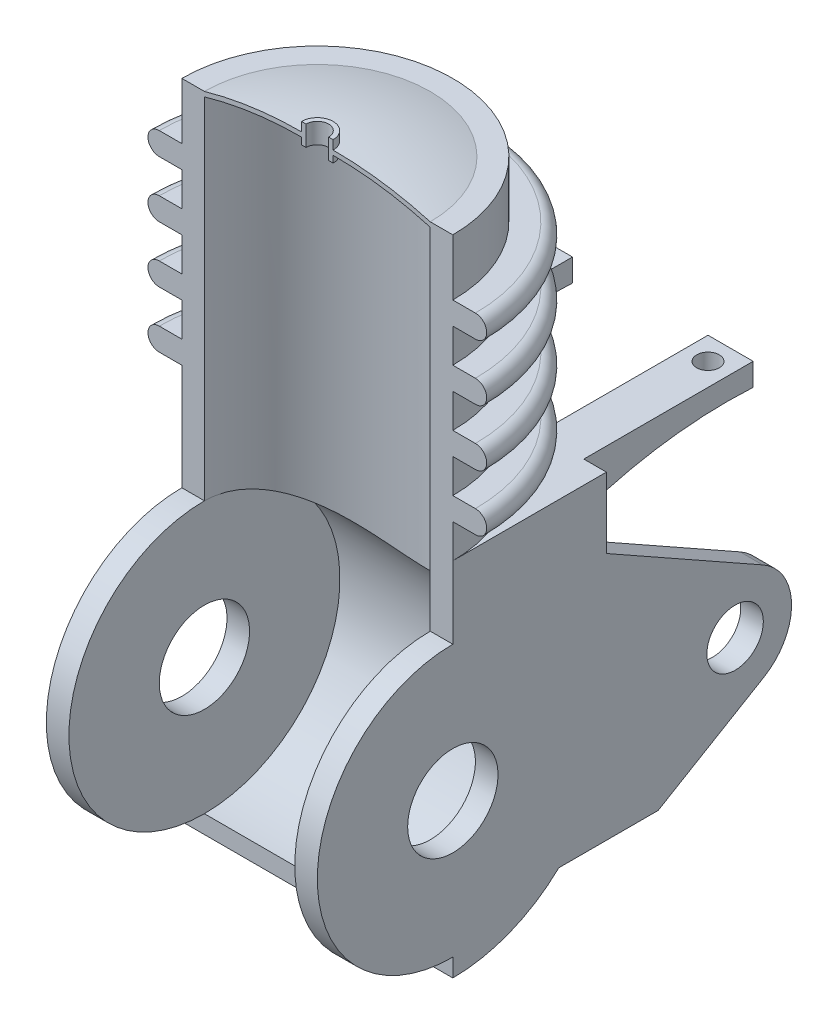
ISO-10303-21;
HEADER;
FILE_DESCRIPTION(('STEP AP214'),'2;1');
FILE_NAME('part.step','',(''),(''),'','','');
FILE_SCHEMA(('AUTOMOTIVE_DESIGN { 1 0 10303 214 1 1 1 1 }'));
ENDSEC;
DATA;
#1=APPLICATION_CONTEXT('core data for automotive mechanical design processes');
#2=APPLICATION_PROTOCOL_DEFINITION('international standard','automotive_design',2000,#1);
#3=PRODUCT_CONTEXT('',#1,'mechanical');
#4=PRODUCT('Part','Part','',(#3));
#5=PRODUCT_RELATED_PRODUCT_CATEGORY('part','',(#4));
#6=PRODUCT_DEFINITION_FORMATION('','',#4);
#7=PRODUCT_DEFINITION_CONTEXT('part definition',#1,'design');
#8=PRODUCT_DEFINITION('design','',#6,#7);
#9=PRODUCT_DEFINITION_SHAPE('','',#8);
#10=(LENGTH_UNIT() NAMED_UNIT(*) SI_UNIT(.MILLI.,.METRE.));
#11=(NAMED_UNIT(*) PLANE_ANGLE_UNIT() SI_UNIT($,.RADIAN.));
#12=(NAMED_UNIT(*) SI_UNIT($,.STERADIAN.) SOLID_ANGLE_UNIT());
#13=UNCERTAINTY_MEASURE_WITH_UNIT(LENGTH_MEASURE(1.E-05),#10,'distance_accuracy_value','');
#14=(GEOMETRIC_REPRESENTATION_CONTEXT(3) GLOBAL_UNCERTAINTY_ASSIGNED_CONTEXT((#13)) GLOBAL_UNIT_ASSIGNED_CONTEXT((#10,
#11,#12)) REPRESENTATION_CONTEXT('',''));
#15=CARTESIAN_POINT('',(0.,0.,0.));
#16=DIRECTION('',(0.,0.,1.));
#17=DIRECTION('',(1.,0.,0.));
#18=AXIS2_PLACEMENT_3D('',#15,#16,#17);
#19=CARTESIAN_POINT('',(60.,160.,-68.));
#20=DIRECTION('',(0.,0.,1.));
#21=DIRECTION('',(1.,0.,0.));
#22=AXIS2_PLACEMENT_3D('',#19,#20,#21);
#23=PLANE('',#22);
#24=DIRECTION('',(0.,-1.,0.));
#25=VECTOR('',#24,1.);
#26=CARTESIAN_POINT('',(-30.,160.,-68.));
#27=LINE('',#26,#25);
#28=CARTESIAN_POINT('',(-30.,160.,-68.));
#29=VERTEX_POINT('',#28);
#30=CARTESIAN_POINT('',(-30.,140.,-68.));
#31=VERTEX_POINT('',#30);
#32=EDGE_CURVE('E366',#29,#31,#27,.T.);
#33=ORIENTED_EDGE('',*,*,#32,.F.);
#34=DIRECTION('',(-1.,0.,0.));
#35=VECTOR('',#34,1.);
#36=CARTESIAN_POINT('',(60.,160.,-68.));
#37=LINE('',#36,#35);
#38=CARTESIAN_POINT('',(30.,160.,-68.));
#39=VERTEX_POINT('',#38);
#40=EDGE_CURVE('E376',#39,#29,#37,.T.);
#41=ORIENTED_EDGE('',*,*,#40,.F.);
#42=DIRECTION('',(0.,-1.,0.));
#43=VECTOR('',#42,1.);
#44=CARTESIAN_POINT('',(30.,160.,-68.));
#45=LINE('',#44,#43);
#46=CARTESIAN_POINT('',(30.,140.,-68.));
#47=VERTEX_POINT('',#46);
#48=EDGE_CURVE('E778',#39,#47,#45,.T.);
#49=ORIENTED_EDGE('',*,*,#48,.T.);
#50=DIRECTION('',(1.,0.,0.));
#51=VECTOR('',#50,1.);
#52=CARTESIAN_POINT('',(30.,140.,-68.));
#53=LINE('',#52,#51);
#54=CARTESIAN_POINT('',(50.,140.,-68.));
#55=VERTEX_POINT('',#54);
#56=EDGE_CURVE('E788',#47,#55,#53,.T.);
#57=ORIENTED_EDGE('',*,*,#56,.T.);
#58=DIRECTION('',(0.,-1.,0.));
#59=VECTOR('',#58,1.);
#60=CARTESIAN_POINT('',(50.,160.,-68.));
#61=LINE('',#60,#59);
#62=CARTESIAN_POINT('',(50.,160.,-68.));
#63=VERTEX_POINT('',#62);
#64=EDGE_CURVE('E773',#63,#55,#61,.T.);
#65=ORIENTED_EDGE('',*,*,#64,.F.);
#66=CARTESIAN_POINT('',(60.,160.,-68.));
#67=VERTEX_POINT('',#66);
#68=EDGE_CURVE('E46',#67,#63,#37,.T.);
#69=ORIENTED_EDGE('',*,*,#68,.F.);
#70=DIRECTION('',(0.,1.,0.));
#71=VECTOR('',#70,1.);
#72=CARTESIAN_POINT('',(60.,160.,-68.));
#73=LINE('',#72,#71);
#74=CARTESIAN_POINT('',(60.,128.790608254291,-68.));
#75=VERTEX_POINT('',#74);
#76=EDGE_CURVE('E408',#75,#67,#73,.T.);
#77=ORIENTED_EDGE('',*,*,#76,.F.);
#78=DIRECTION('',(1.,0.,0.));
#79=VECTOR('',#78,1.);
#80=CARTESIAN_POINT('',(50.,128.790608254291,-68.));
#81=LINE('',#80,#79);
#82=CARTESIAN_POINT('',(50.,128.790608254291,-68.));
#83=VERTEX_POINT('',#82);
#84=EDGE_CURVE('E884',#83,#75,#81,.T.);
#85=ORIENTED_EDGE('',*,*,#84,.F.);
#86=DIRECTION('',(0.,-1.,0.));
#87=VECTOR('',#86,1.);
#88=CARTESIAN_POINT('',(50.,68.,-68.));
#89=LINE('',#88,#87);
#90=CARTESIAN_POINT('',(50.,68.,-68.));
#91=VERTEX_POINT('',#90);
#92=EDGE_CURVE('E871',#83,#91,#89,.T.);
#93=ORIENTED_EDGE('',*,*,#92,.T.);
#94=DIRECTION('',(-1.,0.,0.));
#95=VECTOR('',#94,1.);
#96=CARTESIAN_POINT('',(60.,68.,-68.));
#97=LINE('',#96,#95);
#98=CARTESIAN_POINT('',(-50.,68.,-68.));
#99=VERTEX_POINT('',#98);
#100=EDGE_CURVE('E11',#91,#99,#97,.T.);
#101=ORIENTED_EDGE('',*,*,#100,.T.);
#102=DIRECTION('',(0.,-1.,0.));
#103=VECTOR('',#102,1.);
#104=CARTESIAN_POINT('',(-50.,68.,-68.));
#105=LINE('',#104,#103);
#106=CARTESIAN_POINT('',(-50.,128.790608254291,-68.));
#107=VERTEX_POINT('',#106);
#108=EDGE_CURVE('E814',#107,#99,#105,.T.);
#109=ORIENTED_EDGE('',*,*,#108,.F.);
#110=DIRECTION('',(-1.,0.,0.));
#111=VECTOR('',#110,1.);
#112=CARTESIAN_POINT('',(-50.,128.790608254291,-68.));
#113=LINE('',#112,#111);
#114=CARTESIAN_POINT('',(-60.,128.790608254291,-68.));
#115=VERTEX_POINT('',#114);
#116=EDGE_CURVE('E827',#107,#115,#113,.T.);
#117=ORIENTED_EDGE('',*,*,#116,.T.);
#118=DIRECTION('',(0.,1.,0.));
#119=VECTOR('',#118,1.);
#120=CARTESIAN_POINT('',(-60.,160.,-68.));
#121=LINE('',#120,#119);
#122=CARTESIAN_POINT('',(-60.,160.,-68.));
#123=VERTEX_POINT('',#122);
#124=EDGE_CURVE('E396',#115,#123,#121,.T.);
#125=ORIENTED_EDGE('',*,*,#124,.T.);
#126=CARTESIAN_POINT('',(-50.,160.,-68.));
#127=VERTEX_POINT('',#126);
#128=EDGE_CURVE('E383',#127,#123,#37,.T.);
#129=ORIENTED_EDGE('',*,*,#128,.F.);
#130=DIRECTION('',(0.,-1.,0.));
#131=VECTOR('',#130,1.);
#132=CARTESIAN_POINT('',(-50.,160.,-68.));
#133=LINE('',#132,#131);
#134=CARTESIAN_POINT('',(-50.,140.,-68.));
#135=VERTEX_POINT('',#134);
#136=EDGE_CURVE('E53',#127,#135,#133,.T.);
#137=ORIENTED_EDGE('',*,*,#136,.T.);
#138=DIRECTION('',(-1.,0.,0.));
#139=VECTOR('',#138,1.);
#140=CARTESIAN_POINT('',(-30.,140.,-68.));
#141=LINE('',#140,#139);
#142=EDGE_CURVE('E378',#31,#135,#141,.T.);
#143=ORIENTED_EDGE('',*,*,#142,.F.);
#144=EDGE_LOOP('',(#33,#41,#49,#57,#65,#69,#77,#85,#93,#101,#109,#117,#125,#129,#137,#143));
#145=FACE_BOUND('',#144,.T.);
#146=ADVANCED_FACE('F38',(#145),#23,.F.);
#147=CARTESIAN_POINT('',(60.,68.,0.));
#148=DIRECTION('',(-1.,0.,0.));
#149=DIRECTION('',(0.,0.,1.));
#150=AXIS2_PLACEMENT_3D('',#147,#148,#149);
#151=CYLINDRICAL_SURFACE('',#150,68.);
#152=CARTESIAN_POINT('',(-50.,68.,0.));
#153=DIRECTION('',(-1.,0.,0.));
#154=DIRECTION('',(0.,0.,-1.));
#155=AXIS2_PLACEMENT_3D('',#152,#153,#154);
#156=CIRCLE('',#155,68.0000000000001);
#157=CARTESIAN_POINT('',(-50.,18.7906082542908,-46.9301157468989));
#158=VERTEX_POINT('',#157);
#159=EDGE_CURVE('E811',#99,#158,#156,.T.);
#160=ORIENTED_EDGE('',*,*,#159,.F.);
#161=ORIENTED_EDGE('',*,*,#100,.F.);
#162=CARTESIAN_POINT('',(50.,68.,0.));
#163=DIRECTION('',(-1.,0.,0.));
#164=DIRECTION('',(0.,0.,-1.));
#165=AXIS2_PLACEMENT_3D('',#162,#163,#164);
#166=CIRCLE('',#165,68.0000000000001);
#167=CARTESIAN_POINT('',(50.,18.7906082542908,-46.9301157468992));
#168=VERTEX_POINT('',#167);
#169=EDGE_CURVE('E856',#91,#168,#166,.T.);
#170=ORIENTED_EDGE('',*,*,#169,.T.);
#171=DIRECTION('',(1.,0.,0.));
#172=VECTOR('',#171,1.);
#173=CARTESIAN_POINT('',(50.,18.7906082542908,-46.9301157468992));
#174=LINE('',#173,#172);
#175=CARTESIAN_POINT('',(60.,18.7906082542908,-46.9301157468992));
#176=VERTEX_POINT('',#175);
#177=EDGE_CURVE('E874',#168,#176,#174,.T.);
#178=ORIENTED_EDGE('',*,*,#177,.T.);
#179=CARTESIAN_POINT('',(60.,68.,0.));
#180=DIRECTION('',(1.,0.,0.));
#181=DIRECTION('',(0.,0.,1.));
#182=AXIS2_PLACEMENT_3D('',#179,#180,#181);
#183=CIRCLE('',#182,68.);
#184=CARTESIAN_POINT('',(60.,0.,0.));
#185=VERTEX_POINT('',#184);
#186=EDGE_CURVE('E392',#185,#176,#183,.T.);
#187=ORIENTED_EDGE('',*,*,#186,.F.);
#188=DIRECTION('',(-1.,0.,0.));
#189=VECTOR('',#188,1.);
#190=CARTESIAN_POINT('',(60.,0.,0.));
#191=LINE('',#190,#189);
#192=CARTESIAN_POINT('',(-60.,0.,0.));
#193=VERTEX_POINT('',#192);
#194=EDGE_CURVE('E385',#185,#193,#191,.T.);
#195=ORIENTED_EDGE('',*,*,#194,.T.);
#196=CARTESIAN_POINT('',(-60.,68.,0.));
#197=DIRECTION('',(1.,0.,0.));
#198=DIRECTION('',(0.,0.,1.));
#199=AXIS2_PLACEMENT_3D('',#196,#197,#198);
#200=CIRCLE('',#199,68.);
#201=CARTESIAN_POINT('',(-60.,18.7906082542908,-46.9301157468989));
#202=VERTEX_POINT('',#201);
#203=EDGE_CURVE('E399',#193,#202,#200,.T.);
#204=ORIENTED_EDGE('',*,*,#203,.T.);
#205=DIRECTION('',(-1.,0.,0.));
#206=VECTOR('',#205,1.);
#207=CARTESIAN_POINT('',(-50.,18.7906082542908,-46.9301157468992));
#208=LINE('',#207,#206);
#209=EDGE_CURVE('E835',#158,#202,#208,.T.);
#210=ORIENTED_EDGE('',*,*,#209,.F.);
#211=EDGE_LOOP('',(#160,#161,#170,#178,#187,#195,#204,#210));
#212=FACE_BOUND('',#211,.T.);
#213=ADVANCED_FACE('F40',(#212),#151,.T.);
#214=CARTESIAN_POINT('',(-75.,68.,0.));
#215=DIRECTION('',(1.,0.,0.));
#216=DIRECTION('',(0.,0.,-1.));
#217=AXIS2_PLACEMENT_3D('',#214,#215,#216);
#218=CYLINDRICAL_SURFACE('',#217,60.);
#219=CARTESIAN_POINT('',(-50.,68.,0.));
#220=DIRECTION('',(-1.,0.,0.));
#221=DIRECTION('',(0.,0.,1.));
#222=AXIS2_PLACEMENT_3D('',#219,#220,#221);
#223=CIRCLE('',#222,60.);
#224=CARTESIAN_POINT('',(-50.,128.,0.));
#225=VERTEX_POINT('',#224);
#226=CARTESIAN_POINT('',(-50.,8.00000000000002,0.));
#227=VERTEX_POINT('',#226);
#228=EDGE_CURVE('E899',#225,#227,#223,.T.);
#229=ORIENTED_EDGE('',*,*,#228,.T.);
#230=DIRECTION('',(1.,0.,0.));
#231=VECTOR('',#230,1.);
#232=CARTESIAN_POINT('',(-75.,8.00000000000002,0.));
#233=LINE('',#232,#231);
#234=CARTESIAN_POINT('',(50.,8.00000000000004,0.));
#235=VERTEX_POINT('',#234);
#236=EDGE_CURVE('E625',#235,#227,#233,.F.);
#237=ORIENTED_EDGE('',*,*,#236,.F.);
#238=CARTESIAN_POINT('',(50.,68.,0.));
#239=DIRECTION('',(-1.,0.,0.));
#240=DIRECTION('',(0.,0.,1.));
#241=AXIS2_PLACEMENT_3D('',#238,#239,#240);
#242=CIRCLE('',#241,60.);
#243=CARTESIAN_POINT('',(50.,128.,0.));
#244=VERTEX_POINT('',#243);
#245=EDGE_CURVE('E914',#244,#235,#242,.T.);
#246=ORIENTED_EDGE('',*,*,#245,.F.);
#247=CARTESIAN_POINT('',(-50.,128.,0.));
#248=CARTESIAN_POINT('',(-50.000017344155,128.000018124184,-0.596713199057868));
#249=CARTESIAN_POINT('',(-49.9893183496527,127.991098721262,-1.19341534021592));
#250=CARTESIAN_POINT('',(-49.946617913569,127.955520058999,-2.3855011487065));
#251=CARTESIAN_POINT('',(-49.9146174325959,127.928861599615,-2.98088487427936));
#252=CARTESIAN_POINT('',(-49.8294736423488,127.857964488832,-4.16868124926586));
#253=CARTESIAN_POINT('',(-49.7763449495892,127.813737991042,-4.76109566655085));
#254=CARTESIAN_POINT('',(-49.6492148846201,127.70798366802,-5.94208384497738));
#255=CARTESIAN_POINT('',(-49.5752134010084,127.646455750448,-6.53065758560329));
#256=CARTESIAN_POINT('',(-49.3236668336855,127.437490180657,-8.27981028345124));
#257=CARTESIAN_POINT('',(-49.1158911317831,127.265095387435,-9.43329794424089));
#258=CARTESIAN_POINT('',(-48.6229091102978,126.857184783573,-11.7120780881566));
#259=CARTESIAN_POINT('',(-48.3376929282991,126.621660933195,-12.83736696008));
#260=CARTESIAN_POINT('',(-47.6951291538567,126.092960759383,-15.0498539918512));
#261=CARTESIAN_POINT('',(-47.3379710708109,125.799935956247,-16.1371435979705));
#262=CARTESIAN_POINT('',(-46.5560125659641,125.161275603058,-18.2709926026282));
#263=CARTESIAN_POINT('',(-46.131214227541,124.815641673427,-19.3175532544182));
#264=CARTESIAN_POINT('',(-45.2182281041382,124.076876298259,-21.3675716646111));
#265=CARTESIAN_POINT('',(-44.7299316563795,123.68366351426,-22.370951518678));
#266=CARTESIAN_POINT('',(-43.6954406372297,122.856132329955,-24.3297287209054));
#267=CARTESIAN_POINT('',(-43.1492388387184,122.421808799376,-25.285120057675));
#268=CARTESIAN_POINT('',(-41.7934640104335,121.35224103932,-27.487007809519));
#269=CARTESIAN_POINT('',(-40.960725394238,120.701692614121,-28.7118850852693));
#270=CARTESIAN_POINT('',(-39.2056576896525,119.349491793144,-31.0656276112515));
#271=CARTESIAN_POINT('',(-38.2832981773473,118.647822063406,-32.1944600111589));
#272=CARTESIAN_POINT('',(-36.354864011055,117.206347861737,-34.3573600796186));
#273=CARTESIAN_POINT('',(-35.3486001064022,116.466458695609,-35.3912018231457));
#274=CARTESIAN_POINT('',(-33.2598197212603,114.964748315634,-37.3610127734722));
#275=CARTESIAN_POINT('',(-32.1773129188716,114.202929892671,-38.2969943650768));
#276=CARTESIAN_POINT('',(-30.4885024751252,113.048602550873,-39.6355859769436));
#277=CARTESIAN_POINT('',(-29.9091523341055,112.658291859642,-40.0745671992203));
#278=CARTESIAN_POINT('',(-28.7315367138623,111.878313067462,-40.9270969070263));
#279=CARTESIAN_POINT('',(-28.1332710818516,111.48864497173,-41.340645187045));
#280=CARTESIAN_POINT('',(-26.9176467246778,110.712303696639,-42.1422659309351));
#281=CARTESIAN_POINT('',(-26.3002814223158,110.325631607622,-42.5303294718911));
#282=CARTESIAN_POINT('',(-25.0464685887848,109.55814952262,-43.2805746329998));
#283=CARTESIAN_POINT('',(-24.4100212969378,109.177339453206,-43.642756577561));
#284=CARTESIAN_POINT('',(-23.1192560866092,108.425553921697,-44.3400132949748));
#285=CARTESIAN_POINT('',(-22.4649846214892,108.054557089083,-44.6751509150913));
#286=CARTESIAN_POINT('',(-21.1366321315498,107.324917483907,-45.3187323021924));
#287=CARTESIAN_POINT('',(-20.4625500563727,106.966275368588,-45.6271746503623));
#288=CARTESIAN_POINT('',(-19.0945824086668,106.265626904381,-46.2163513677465));
#289=CARTESIAN_POINT('',(-18.4007112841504,105.923608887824,-46.4971053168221));
#290=CARTESIAN_POINT('',(-16.9923685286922,105.260632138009,-47.0300559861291));
#291=CARTESIAN_POINT('',(-16.2779006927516,104.939669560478,-47.2822579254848));
#292=CARTESIAN_POINT('',(-14.7596527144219,104.295061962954,-47.7791718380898));
#293=CARTESIAN_POINT('',(-13.9537963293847,103.974008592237,-48.020943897));
#294=CARTESIAN_POINT('',(-12.3171920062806,103.37138248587,-48.4665432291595));
#295=CARTESIAN_POINT('',(-11.4864474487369,103.089804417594,-48.6703756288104));
#296=CARTESIAN_POINT('',(-9.8029478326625,102.575383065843,-49.0371555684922));
#297=CARTESIAN_POINT('',(-8.95024184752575,102.342440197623,-49.2001867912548));
#298=CARTESIAN_POINT('',(-7.22406500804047,101.93353070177,-49.483103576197));
#299=CARTESIAN_POINT('',(-6.35059433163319,101.757563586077,-49.6029895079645));
#300=CARTESIAN_POINT('',(-4.57677658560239,101.468973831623,-49.7981809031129));
#301=CARTESIAN_POINT('',(-3.67622992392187,101.357172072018,-49.8729092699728));
#302=CARTESIAN_POINT('',(-1.86631831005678,101.206480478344,-49.9733733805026));
#303=CARTESIAN_POINT('',(-0.956954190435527,101.167583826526,-49.9991137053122));
#304=CARTESIAN_POINT('',(0.861939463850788,101.164980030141,-50.0008411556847));
#305=CARTESIAN_POINT('',(1.77146899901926,101.201273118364,-49.9768281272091));
#306=CARTESIAN_POINT('',(3.58200251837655,101.346902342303,-49.8797707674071));
#307=CARTESIAN_POINT('',(4.48300545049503,101.456247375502,-49.8067204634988));
#308=CARTESIAN_POINT('',(6.34316558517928,101.753875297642,-49.6055503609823));
#309=CARTESIAN_POINT('',(7.30094518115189,101.947955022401,-49.4733642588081));
#310=CARTESIAN_POINT('',(9.19129964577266,102.40403206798,-49.1572894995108));
#311=CARTESIAN_POINT('',(10.1238705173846,102.666040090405,-48.9733926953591));
#312=CARTESIAN_POINT('',(11.9627582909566,103.246899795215,-48.5570171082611));
#313=CARTESIAN_POINT('',(12.8689938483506,103.565909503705,-48.3244029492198));
#314=CARTESIAN_POINT('',(14.6512718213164,104.248887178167,-47.8142208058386));
#315=CARTESIAN_POINT('',(15.5273113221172,104.612859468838,-47.5366484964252));
#316=CARTESIAN_POINT('',(17.0721724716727,105.297228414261,-47.0006919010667));
#317=CARTESIAN_POINT('',(17.7465850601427,105.611211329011,-46.750084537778));
#318=CARTESIAN_POINT('',(19.0767850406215,106.256835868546,-46.2232418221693));
#319=CARTESIAN_POINT('',(19.7325700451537,106.588479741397,-45.9470032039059));
#320=CARTESIAN_POINT('',(21.02614611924,107.265697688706,-45.3696275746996));
#321=CARTESIAN_POINT('',(21.663928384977,107.611278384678,-45.0684786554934));
#322=CARTESIAN_POINT('',(22.921586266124,108.312861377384,-44.4420340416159));
#323=CARTESIAN_POINT('',(23.5414625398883,108.668863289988,-44.1167392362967));
#324=CARTESIAN_POINT('',(24.7645212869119,109.388848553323,-43.4419949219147));
#325=CARTESIAN_POINT('',(25.3676805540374,109.752841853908,-43.0925139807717));
#326=CARTESIAN_POINT('',(26.5567232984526,110.485769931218,-42.3700876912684));
#327=CARTESIAN_POINT('',(27.1426052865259,110.854705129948,-41.9971403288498));
#328=CARTESIAN_POINT('',(28.8742201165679,111.965147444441,-40.8436506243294));
#329=CARTESIAN_POINT('',(29.9944368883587,112.710598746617,-40.028175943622));
#330=CARTESIAN_POINT('',(32.2225329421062,114.234163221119,-38.2600983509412));
#331=CARTESIAN_POINT('',(33.3267131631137,115.0119491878,-37.3025583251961));
#332=CARTESIAN_POINT('',(35.455598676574,116.544350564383,-35.2852752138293));
#333=CARTESIAN_POINT('',(36.4802919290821,117.298962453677,-34.2255166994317));
#334=CARTESIAN_POINT('',(38.442253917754,118.767954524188,-32.0059873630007));
#335=CARTESIAN_POINT('',(39.3796675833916,119.482400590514,-30.8463887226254));
#336=CARTESIAN_POINT('',(41.1601971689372,120.856804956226,-28.4269626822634));
#337=CARTESIAN_POINT('',(42.0033458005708,121.516782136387,-27.167170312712));
#338=CARTESIAN_POINT('',(43.3916088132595,122.614083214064,-24.8697452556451));
#339=CARTESIAN_POINT('',(43.9592607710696,123.066455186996,-23.8528569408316));
#340=CARTESIAN_POINT('',(45.0290359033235,123.924161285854,-21.7660322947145));
#341=CARTESIAN_POINT('',(45.5311650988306,124.329499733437,-20.696100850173));
#342=CARTESIAN_POINT('',(46.4630497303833,125.085382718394,-18.5093126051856));
#343=CARTESIAN_POINT('',(46.8929547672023,125.436040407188,-17.3925589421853));
#344=CARTESIAN_POINT('',(47.6757010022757,126.076862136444,-15.1154300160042));
#345=CARTESIAN_POINT('',(48.0285500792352,126.367032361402,-13.9550592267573));
#346=CARTESIAN_POINT('',(48.6104202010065,126.846832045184,-11.7535998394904));
#347=CARTESIAN_POINT('',(48.8496381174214,127.044676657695,-10.7169819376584));
#348=CARTESIAN_POINT('',(49.2625556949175,127.386748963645,-8.62203111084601));
#349=CARTESIAN_POINT('',(49.4362675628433,127.530986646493,-7.5637022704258));
#350=CARTESIAN_POINT('',(49.6462407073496,127.705508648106,-5.96185571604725));
#351=CARTESIAN_POINT('',(49.7079147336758,127.756806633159,-5.42376845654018));
#352=CARTESIAN_POINT('',(49.8138299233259,127.844939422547,-4.34466746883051));
#353=CARTESIAN_POINT('',(49.8580711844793,127.881774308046,-3.80365375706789));
#354=CARTESIAN_POINT('',(49.9289529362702,127.940803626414,-2.71936833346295));
#355=CARTESIAN_POINT('',(49.955583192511,127.962989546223,-2.17609549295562));
#356=CARTESIAN_POINT('',(49.9911130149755,127.992594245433,-1.0885510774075));
#357=CARTESIAN_POINT('',(50.0000119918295,128.000012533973,-0.544279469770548));
#358=CARTESIAN_POINT('',(50.,128.,0.));
#359=B_SPLINE_CURVE_WITH_KNOTS('',3,(#247,#248,#249,#250,#251,#252,#253,#254,#255,#256,#257,
#258,#259,#260,#261,#262,#263,#264,#265,#266,#267,#268,#269,#270,#271,#272,#273,#274,#275,#276,
#277,#278,#279,#280,#281,#282,#283,#284,#285,#286,#287,#288,#289,#290,#291,#292,#293,#294,#295,
#296,#297,#298,#299,#300,#301,#302,#303,#304,#305,#306,#307,#308,#309,#310,#311,#312,#313,#314,
#315,#316,#317,#318,#319,#320,#321,#322,#323,#324,#325,#326,#327,#328,#329,#330,#331,#332,#333,
#334,#335,#336,#337,#338,#339,#340,#341,#342,#343,#344,#345,#346,#347,#348,#349,#350,#351,#352,
#353,#354,#355,#356,#357,#358),.UNSPECIFIED.,.F.,.F.,(4,2,2,2,2,2,2,2,2,2,2,2,2,2,2,2,2,2,2,2,2,
2,2,2,2,2,2,2,2,2,2,2,2,2,2,2,2,2,2,2,2,2,2,2,2,2,2,2,2,2,2,2,2,2,2,4),(0.,1.78995737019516,
3.57983402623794,5.36847459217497,7.15712470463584,10.7059723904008,14.2552722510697,
17.7953420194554,21.3353027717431,24.8814031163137,28.4279465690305,33.2741147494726,
38.1219338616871,42.9809996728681,47.8394497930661,50.3140791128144,52.7887284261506,
55.2642396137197,57.7397197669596,60.209270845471,62.6789530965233,65.1468761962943,
67.6143474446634,70.3140934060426,73.0134743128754,75.7072725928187,78.4010477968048,
81.1285579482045,83.8558130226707,86.5830765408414,89.3106722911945,92.2645809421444,
95.2189552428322,98.1816507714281,101.144631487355,103.498778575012,105.853226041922,
108.208805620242,110.564298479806,112.922912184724,115.281728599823,119.997374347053,
124.959272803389,129.921921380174,134.876176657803,139.828707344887,143.573472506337,
147.317893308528,151.054459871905,154.790644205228,158.033699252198,161.276149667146,
162.907858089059,164.539557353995,166.172204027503,167.804904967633),.UNSPECIFIED.);
#360=EDGE_CURVE('E626',#225,#244,#359,.T.);
#361=ORIENTED_EDGE('',*,*,#360,.F.);
#362=EDGE_LOOP('',(#229,#237,#246,#361));
#363=FACE_BOUND('',#362,.T.);
#364=ADVANCED_FACE('F948',(#363),#218,.F.);
#365=CARTESIAN_POINT('',(60.,0.,0.));
#366=DIRECTION('',(0.,0.,-1.));
#367=DIRECTION('',(-1.,0.,0.));
#368=AXIS2_PLACEMENT_3D('',#365,#366,#367);
#369=PLANE('',#368);
#370=DIRECTION('',(1.,0.,0.));
#371=VECTOR('',#370,1.);
#372=CARTESIAN_POINT('',(-75.,128.,0.));
#373=LINE('',#372,#371);
#374=CARTESIAN_POINT('',(-60.,128.,0.));
#375=VERTEX_POINT('',#374);
#376=EDGE_CURVE('E619',#375,#225,#373,.T.);
#377=ORIENTED_EDGE('',*,*,#376,.T.);
#378=DIRECTION('',(0.,-1.,0.));
#379=VECTOR('',#378,1.);
#380=CARTESIAN_POINT('',(-50.,160.,3.49148133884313E-13));
#381=LINE('',#380,#379);
#382=CARTESIAN_POINT('',(-50.,282.919441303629,3.49148133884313E-13));
#383=VERTEX_POINT('',#382);
#384=EDGE_CURVE('E464',#383,#225,#381,.T.);
#385=ORIENTED_EDGE('',*,*,#384,.F.);
#386=CARTESIAN_POINT('',(-7.01162794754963,134.000000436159,0.));
#387=DIRECTION('',(0.,0.,1.));
#388=DIRECTION('',(1.,0.,0.));
#389=AXIS2_PLACEMENT_3D('',#386,#387,#388);
#390=CIRCLE('',#389,155.);
#391=CARTESIAN_POINT('',(-7.,289.,0.));
#392=VERTEX_POINT('',#391);
#393=EDGE_CURVE('E466',#392,#383,#390,.T.);
#394=ORIENTED_EDGE('',*,*,#393,.F.);
#395=DIRECTION('',(0.,1.,0.));
#396=VECTOR('',#395,1.);
#397=CARTESIAN_POINT('',(-7.,286.,0.));
#398=LINE('',#397,#396);
#399=CARTESIAN_POINT('',(-7.,286.,0.));
#400=VERTEX_POINT('',#399);
#401=EDGE_CURVE('E469',#400,#392,#398,.T.);
#402=ORIENTED_EDGE('',*,*,#401,.F.);
#403=DIRECTION('',(-1.,0.,0.));
#404=VECTOR('',#403,1.);
#405=CARTESIAN_POINT('',(-5.,286.,0.));
#406=LINE('',#405,#404);
#407=CARTESIAN_POINT('',(-5.,286.,0.));
#408=VERTEX_POINT('',#407);
#409=EDGE_CURVE('E472',#408,#400,#406,.T.);
#410=ORIENTED_EDGE('',*,*,#409,.F.);
#411=DIRECTION('',(0.,-1.,0.));
#412=VECTOR('',#411,1.);
#413=CARTESIAN_POINT('',(-5.,295.,0.));
#414=LINE('',#413,#412);
#415=CARTESIAN_POINT('',(-5.,295.,0.));
#416=VERTEX_POINT('',#415);
#417=EDGE_CURVE('E475',#416,#408,#414,.T.);
#418=ORIENTED_EDGE('',*,*,#417,.F.);
#419=DIRECTION('',(1.,0.,0.));
#420=VECTOR('',#419,1.);
#421=CARTESIAN_POINT('',(-7.,295.,0.));
#422=LINE('',#421,#420);
#423=CARTESIAN_POINT('',(-7.,295.,0.));
#424=VERTEX_POINT('',#423);
#425=EDGE_CURVE('E478',#424,#416,#422,.T.);
#426=ORIENTED_EDGE('',*,*,#425,.F.);
#427=DIRECTION('',(0.,1.,0.));
#428=VECTOR('',#427,1.);
#429=CARTESIAN_POINT('',(-7.,291.000000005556,0.));
#430=LINE('',#429,#428);
#431=CARTESIAN_POINT('',(-7.,291.000000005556,0.));
#432=VERTEX_POINT('',#431);
#433=EDGE_CURVE('E481',#432,#424,#430,.T.);
#434=ORIENTED_EDGE('',*,*,#433,.F.);
#435=CARTESIAN_POINT('',(-7.01162794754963,134.000000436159,0.));
#436=DIRECTION('',(0.,0.,-1.));
#437=DIRECTION('',(-1.,0.,0.));
#438=AXIS2_PLACEMENT_3D('',#435,#436,#437);
#439=CIRCLE('',#438,157.);
#440=CARTESIAN_POINT('',(-50.,285.,3.49148133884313E-13));
#441=VERTEX_POINT('',#440);
#442=EDGE_CURVE('E484',#441,#432,#439,.T.);
#443=ORIENTED_EDGE('',*,*,#442,.F.);
#444=DIRECTION('',(1.,0.,0.));
#445=VECTOR('',#444,1.);
#446=CARTESIAN_POINT('',(-60.,285.,4.18977760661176E-13));
#447=LINE('',#446,#445);
#448=CARTESIAN_POINT('',(-60.,285.,4.18977760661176E-13));
#449=VERTEX_POINT('',#448);
#450=EDGE_CURVE('E487',#449,#441,#447,.T.);
#451=ORIENTED_EDGE('',*,*,#450,.F.);
#452=DIRECTION('',(0.,1.,0.));
#453=VECTOR('',#452,1.);
#454=CARTESIAN_POINT('',(-60.,260.,4.18977760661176E-13));
#455=LINE('',#454,#453);
#456=CARTESIAN_POINT('',(-60.,260.,4.18977760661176E-13));
#457=VERTEX_POINT('',#456);
#458=EDGE_CURVE('E490',#457,#449,#455,.T.);
#459=ORIENTED_EDGE('',*,*,#458,.F.);
#460=DIRECTION('',(1.,0.,0.));
#461=VECTOR('',#460,1.);
#462=CARTESIAN_POINT('',(-70.,260.,4.88807387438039E-13));
#463=LINE('',#462,#461);
#464=CARTESIAN_POINT('',(-70.,260.,4.88807387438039E-13));
#465=VERTEX_POINT('',#464);
#466=EDGE_CURVE('E493',#465,#457,#463,.T.);
#467=ORIENTED_EDGE('',*,*,#466,.F.);
#468=CARTESIAN_POINT('',(-70.,255.,4.88807387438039E-13));
#469=DIRECTION('',(0.,0.,-1.));
#470=DIRECTION('',(-1.,0.,0.));
#471=AXIS2_PLACEMENT_3D('',#468,#469,#470);
#472=CIRCLE('',#471,5.00000000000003);
#473=CARTESIAN_POINT('',(-70.,250.,4.88807387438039E-13));
#474=VERTEX_POINT('',#473);
#475=EDGE_CURVE('E496',#474,#465,#472,.T.);
#476=ORIENTED_EDGE('',*,*,#475,.F.);
#477=DIRECTION('',(-1.,0.,0.));
#478=VECTOR('',#477,1.);
#479=CARTESIAN_POINT('',(-60.,250.,4.18977760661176E-13));
#480=LINE('',#479,#478);
#481=CARTESIAN_POINT('',(-60.,250.,4.18977760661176E-13));
#482=VERTEX_POINT('',#481);
#483=EDGE_CURVE('E499',#482,#474,#480,.T.);
#484=ORIENTED_EDGE('',*,*,#483,.F.);
#485=DIRECTION('',(0.,1.,0.));
#486=VECTOR('',#485,1.);
#487=CARTESIAN_POINT('',(-60.,235.,4.18977760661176E-13));
#488=LINE('',#487,#486);
#489=CARTESIAN_POINT('',(-60.,235.,4.18977760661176E-13));
#490=VERTEX_POINT('',#489);
#491=EDGE_CURVE('E502',#490,#482,#488,.T.);
#492=ORIENTED_EDGE('',*,*,#491,.F.);
#493=DIRECTION('',(1.,0.,0.));
#494=VECTOR('',#493,1.);
#495=CARTESIAN_POINT('',(-70.,235.,4.88807387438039E-13));
#496=LINE('',#495,#494);
#497=CARTESIAN_POINT('',(-70.,235.,4.88807387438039E-13));
#498=VERTEX_POINT('',#497);
#499=EDGE_CURVE('E505',#498,#490,#496,.T.);
#500=ORIENTED_EDGE('',*,*,#499,.F.);
#501=CARTESIAN_POINT('',(-70.,230.,4.88807387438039E-13));
#502=DIRECTION('',(0.,0.,-1.));
#503=DIRECTION('',(-1.,0.,0.));
#504=AXIS2_PLACEMENT_3D('',#501,#502,#503);
#505=CIRCLE('',#504,4.99999999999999);
#506=CARTESIAN_POINT('',(-70.,225.,4.88807387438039E-13));
#507=VERTEX_POINT('',#506);
#508=EDGE_CURVE('E508',#507,#498,#505,.T.);
#509=ORIENTED_EDGE('',*,*,#508,.F.);
#510=DIRECTION('',(-1.,0.,0.));
#511=VECTOR('',#510,1.);
#512=CARTESIAN_POINT('',(-60.,225.,4.18977760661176E-13));
#513=LINE('',#512,#511);
#514=CARTESIAN_POINT('',(-60.,225.,4.18977760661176E-13));
#515=VERTEX_POINT('',#514);
#516=EDGE_CURVE('E511',#515,#507,#513,.T.);
#517=ORIENTED_EDGE('',*,*,#516,.F.);
#518=DIRECTION('',(0.,1.,0.));
#519=VECTOR('',#518,1.);
#520=CARTESIAN_POINT('',(-60.,210.,4.18977760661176E-13));
#521=LINE('',#520,#519);
#522=CARTESIAN_POINT('',(-60.,210.,4.18977760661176E-13));
#523=VERTEX_POINT('',#522);
#524=EDGE_CURVE('E514',#523,#515,#521,.T.);
#525=ORIENTED_EDGE('',*,*,#524,.F.);
#526=DIRECTION('',(1.,0.,0.));
#527=VECTOR('',#526,1.);
#528=CARTESIAN_POINT('',(-70.,210.,4.88807387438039E-13));
#529=LINE('',#528,#527);
#530=CARTESIAN_POINT('',(-70.,210.,4.88807387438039E-13));
#531=VERTEX_POINT('',#530);
#532=EDGE_CURVE('E517',#531,#523,#529,.T.);
#533=ORIENTED_EDGE('',*,*,#532,.F.);
#534=CARTESIAN_POINT('',(-70.,205.,4.88807387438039E-13));
#535=DIRECTION('',(0.,0.,-1.));
#536=DIRECTION('',(-1.,0.,0.));
#537=AXIS2_PLACEMENT_3D('',#534,#535,#536);
#538=CIRCLE('',#537,4.99999999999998);
#539=CARTESIAN_POINT('',(-70.,200.,4.88807387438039E-13));
#540=VERTEX_POINT('',#539);
#541=EDGE_CURVE('E520',#540,#531,#538,.T.);
#542=ORIENTED_EDGE('',*,*,#541,.F.);
#543=DIRECTION('',(-1.,0.,0.));
#544=VECTOR('',#543,1.);
#545=CARTESIAN_POINT('',(-60.,200.,4.18977760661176E-13));
#546=LINE('',#545,#544);
#547=CARTESIAN_POINT('',(-60.,200.,4.18977760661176E-13));
#548=VERTEX_POINT('',#547);
#549=EDGE_CURVE('E523',#548,#540,#546,.T.);
#550=ORIENTED_EDGE('',*,*,#549,.F.);
#551=DIRECTION('',(0.,1.,0.));
#552=VECTOR('',#551,1.);
#553=CARTESIAN_POINT('',(-60.,185.,4.18977760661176E-13));
#554=LINE('',#553,#552);
#555=CARTESIAN_POINT('',(-60.,185.,4.18977760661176E-13));
#556=VERTEX_POINT('',#555);
#557=EDGE_CURVE('E526',#556,#548,#554,.T.);
#558=ORIENTED_EDGE('',*,*,#557,.F.);
#559=DIRECTION('',(1.,0.,0.));
#560=VECTOR('',#559,1.);
#561=CARTESIAN_POINT('',(-70.,185.,4.88807387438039E-13));
#562=LINE('',#561,#560);
#563=CARTESIAN_POINT('',(-70.,185.,4.88807387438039E-13));
#564=VERTEX_POINT('',#563);
#565=EDGE_CURVE('E529',#564,#556,#562,.T.);
#566=ORIENTED_EDGE('',*,*,#565,.F.);
#567=CARTESIAN_POINT('',(-70.,180.,4.88807387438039E-13));
#568=DIRECTION('',(0.,0.,-1.));
#569=DIRECTION('',(1.,0.,0.));
#570=AXIS2_PLACEMENT_3D('',#567,#568,#569);
#571=CIRCLE('',#570,5.);
#572=CARTESIAN_POINT('',(-70.,175.,4.88807387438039E-13));
#573=VERTEX_POINT('',#572);
#574=EDGE_CURVE('E532',#573,#564,#571,.T.);
#575=ORIENTED_EDGE('',*,*,#574,.F.);
#576=DIRECTION('',(-1.,0.,0.));
#577=VECTOR('',#576,1.);
#578=CARTESIAN_POINT('',(-60.,175.,4.18977760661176E-13));
#579=LINE('',#578,#577);
#580=CARTESIAN_POINT('',(-60.,175.,4.18977760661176E-13));
#581=VERTEX_POINT('',#580);
#582=EDGE_CURVE('E535',#581,#573,#579,.T.);
#583=ORIENTED_EDGE('',*,*,#582,.F.);
#584=DIRECTION('',(0.,1.,0.));
#585=VECTOR('',#584,1.);
#586=CARTESIAN_POINT('',(-60.,160.,4.18977760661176E-13));
#587=LINE('',#586,#585);
#588=CARTESIAN_POINT('',(-60.,160.,4.18977760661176E-13));
#589=VERTEX_POINT('',#588);
#590=EDGE_CURVE('E538',#589,#581,#587,.T.);
#591=ORIENTED_EDGE('',*,*,#590,.F.);
#592=DIRECTION('',(0.,-1.,0.));
#593=VECTOR('',#592,1.);
#594=CARTESIAN_POINT('',(-60.,0.,0.));
#595=LINE('',#594,#593);
#596=EDGE_CURVE('E390',#589,#375,#595,.T.);
#597=ORIENTED_EDGE('',*,*,#596,.T.);
#598=EDGE_LOOP('',(#377,#385,#394,#402,#410,#418,#426,#434,#443,#451,#459,#467,#476,#484,#492,
#500,#509,#517,#525,#533,#542,#550,#558,#566,#575,#583,#591,#597));
#599=FACE_BOUND('',#598,.T.);
#600=ADVANCED_FACE('F941',(#599),#369,.F.);
#601=DIRECTION('',(0.,-1.,0.));
#602=VECTOR('',#601,1.);
#603=CARTESIAN_POINT('',(50.,160.,0.));
#604=LINE('',#603,#602);
#605=CARTESIAN_POINT('',(50.,282.919441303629,0.));
#606=VERTEX_POINT('',#605);
#607=EDGE_CURVE('E541',#606,#244,#604,.T.);
#608=ORIENTED_EDGE('',*,*,#607,.T.);
#609=CARTESIAN_POINT('',(60.,128.,0.));
#610=VERTEX_POINT('',#609);
#611=EDGE_CURVE('E622',#244,#610,#373,.T.);
#612=ORIENTED_EDGE('',*,*,#611,.T.);
#613=DIRECTION('',(0.,-1.,0.));
#614=VECTOR('',#613,1.);
#615=CARTESIAN_POINT('',(60.,0.,0.));
#616=LINE('',#615,#614);
#617=CARTESIAN_POINT('',(60.,160.,0.));
#618=VERTEX_POINT('',#617);
#619=EDGE_CURVE('E389',#618,#610,#616,.T.);
#620=ORIENTED_EDGE('',*,*,#619,.F.);
#621=DIRECTION('',(0.,1.,0.));
#622=VECTOR('',#621,1.);
#623=CARTESIAN_POINT('',(60.,160.,0.));
#624=LINE('',#623,#622);
#625=CARTESIAN_POINT('',(60.,175.,0.));
#626=VERTEX_POINT('',#625);
#627=EDGE_CURVE('E616',#618,#626,#624,.T.);
#628=ORIENTED_EDGE('',*,*,#627,.T.);
#629=DIRECTION('',(1.,0.,0.));
#630=VECTOR('',#629,1.);
#631=CARTESIAN_POINT('',(60.,175.,0.));
#632=LINE('',#631,#630);
#633=CARTESIAN_POINT('',(70.,175.,0.));
#634=VERTEX_POINT('',#633);
#635=EDGE_CURVE('E613',#626,#634,#632,.T.);
#636=ORIENTED_EDGE('',*,*,#635,.T.);
#637=CARTESIAN_POINT('',(70.,180.,0.));
#638=DIRECTION('',(0.,0.,1.));
#639=DIRECTION('',(-1.,0.,0.));
#640=AXIS2_PLACEMENT_3D('',#637,#638,#639);
#641=CIRCLE('',#640,5.);
#642=CARTESIAN_POINT('',(70.,185.,0.));
#643=VERTEX_POINT('',#642);
#644=EDGE_CURVE('E610',#634,#643,#641,.T.);
#645=ORIENTED_EDGE('',*,*,#644,.T.);
#646=DIRECTION('',(-1.,0.,0.));
#647=VECTOR('',#646,1.);
#648=CARTESIAN_POINT('',(70.,185.,0.));
#649=LINE('',#648,#647);
#650=CARTESIAN_POINT('',(60.,185.,0.));
#651=VERTEX_POINT('',#650);
#652=EDGE_CURVE('E607',#643,#651,#649,.T.);
#653=ORIENTED_EDGE('',*,*,#652,.T.);
#654=DIRECTION('',(0.,1.,0.));
#655=VECTOR('',#654,1.);
#656=CARTESIAN_POINT('',(60.,185.,0.));
#657=LINE('',#656,#655);
#658=CARTESIAN_POINT('',(60.,200.,0.));
#659=VERTEX_POINT('',#658);
#660=EDGE_CURVE('E604',#651,#659,#657,.T.);
#661=ORIENTED_EDGE('',*,*,#660,.T.);
#662=DIRECTION('',(1.,0.,0.));
#663=VECTOR('',#662,1.);
#664=CARTESIAN_POINT('',(60.,200.,0.));
#665=LINE('',#664,#663);
#666=CARTESIAN_POINT('',(70.,200.,0.));
#667=VERTEX_POINT('',#666);
#668=EDGE_CURVE('E601',#659,#667,#665,.T.);
#669=ORIENTED_EDGE('',*,*,#668,.T.);
#670=CARTESIAN_POINT('',(70.,205.,0.));
#671=DIRECTION('',(0.,0.,1.));
#672=DIRECTION('',(1.,0.,0.));
#673=AXIS2_PLACEMENT_3D('',#670,#671,#672);
#674=CIRCLE('',#673,4.99999999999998);
#675=CARTESIAN_POINT('',(70.,210.,0.));
#676=VERTEX_POINT('',#675);
#677=EDGE_CURVE('E598',#667,#676,#674,.T.);
#678=ORIENTED_EDGE('',*,*,#677,.T.);
#679=DIRECTION('',(-1.,0.,0.));
#680=VECTOR('',#679,1.);
#681=CARTESIAN_POINT('',(70.,210.,0.));
#682=LINE('',#681,#680);
#683=CARTESIAN_POINT('',(60.,210.,0.));
#684=VERTEX_POINT('',#683);
#685=EDGE_CURVE('E595',#676,#684,#682,.T.);
#686=ORIENTED_EDGE('',*,*,#685,.T.);
#687=DIRECTION('',(0.,1.,0.));
#688=VECTOR('',#687,1.);
#689=CARTESIAN_POINT('',(60.,210.,0.));
#690=LINE('',#689,#688);
#691=CARTESIAN_POINT('',(60.,225.,0.));
#692=VERTEX_POINT('',#691);
#693=EDGE_CURVE('E592',#684,#692,#690,.T.);
#694=ORIENTED_EDGE('',*,*,#693,.T.);
#695=DIRECTION('',(1.,0.,0.));
#696=VECTOR('',#695,1.);
#697=CARTESIAN_POINT('',(60.,225.,0.));
#698=LINE('',#697,#696);
#699=CARTESIAN_POINT('',(70.,225.,0.));
#700=VERTEX_POINT('',#699);
#701=EDGE_CURVE('E589',#692,#700,#698,.T.);
#702=ORIENTED_EDGE('',*,*,#701,.T.);
#703=CARTESIAN_POINT('',(70.,230.,0.));
#704=DIRECTION('',(0.,0.,1.));
#705=DIRECTION('',(1.,0.,0.));
#706=AXIS2_PLACEMENT_3D('',#703,#704,#705);
#707=CIRCLE('',#706,4.99999999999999);
#708=CARTESIAN_POINT('',(70.,235.,0.));
#709=VERTEX_POINT('',#708);
#710=EDGE_CURVE('E586',#700,#709,#707,.T.);
#711=ORIENTED_EDGE('',*,*,#710,.T.);
#712=DIRECTION('',(-1.,0.,0.));
#713=VECTOR('',#712,1.);
#714=CARTESIAN_POINT('',(70.,235.,0.));
#715=LINE('',#714,#713);
#716=CARTESIAN_POINT('',(60.,235.,0.));
#717=VERTEX_POINT('',#716);
#718=EDGE_CURVE('E583',#709,#717,#715,.T.);
#719=ORIENTED_EDGE('',*,*,#718,.T.);
#720=DIRECTION('',(0.,1.,0.));
#721=VECTOR('',#720,1.);
#722=CARTESIAN_POINT('',(60.,235.,0.));
#723=LINE('',#722,#721);
#724=CARTESIAN_POINT('',(60.,250.,0.));
#725=VERTEX_POINT('',#724);
#726=EDGE_CURVE('E580',#717,#725,#723,.T.);
#727=ORIENTED_EDGE('',*,*,#726,.T.);
#728=DIRECTION('',(1.,0.,0.));
#729=VECTOR('',#728,1.);
#730=CARTESIAN_POINT('',(60.,250.,0.));
#731=LINE('',#730,#729);
#732=CARTESIAN_POINT('',(70.,250.,0.));
#733=VERTEX_POINT('',#732);
#734=EDGE_CURVE('E577',#725,#733,#731,.T.);
#735=ORIENTED_EDGE('',*,*,#734,.T.);
#736=CARTESIAN_POINT('',(70.,255.,0.));
#737=DIRECTION('',(0.,0.,1.));
#738=DIRECTION('',(1.,0.,0.));
#739=AXIS2_PLACEMENT_3D('',#736,#737,#738);
#740=CIRCLE('',#739,5.00000000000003);
#741=CARTESIAN_POINT('',(70.,260.,0.));
#742=VERTEX_POINT('',#741);
#743=EDGE_CURVE('E574',#733,#742,#740,.T.);
#744=ORIENTED_EDGE('',*,*,#743,.T.);
#745=DIRECTION('',(-1.,0.,0.));
#746=VECTOR('',#745,1.);
#747=CARTESIAN_POINT('',(70.,260.,0.));
#748=LINE('',#747,#746);
#749=CARTESIAN_POINT('',(60.,260.,0.));
#750=VERTEX_POINT('',#749);
#751=EDGE_CURVE('E571',#742,#750,#748,.T.);
#752=ORIENTED_EDGE('',*,*,#751,.T.);
#753=DIRECTION('',(0.,1.,0.));
#754=VECTOR('',#753,1.);
#755=CARTESIAN_POINT('',(60.,260.,0.));
#756=LINE('',#755,#754);
#757=CARTESIAN_POINT('',(60.,285.,0.));
#758=VERTEX_POINT('',#757);
#759=EDGE_CURVE('E568',#750,#758,#756,.T.);
#760=ORIENTED_EDGE('',*,*,#759,.T.);
#761=DIRECTION('',(-1.,0.,0.));
#762=VECTOR('',#761,1.);
#763=CARTESIAN_POINT('',(60.,285.,0.));
#764=LINE('',#763,#762);
#765=CARTESIAN_POINT('',(50.,285.,0.));
#766=VERTEX_POINT('',#765);
#767=EDGE_CURVE('E565',#758,#766,#764,.T.);
#768=ORIENTED_EDGE('',*,*,#767,.T.);
#769=CARTESIAN_POINT('',(7.01162794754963,134.000000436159,0.));
#770=DIRECTION('',(0.,0.,1.));
#771=DIRECTION('',(1.,0.,0.));
#772=AXIS2_PLACEMENT_3D('',#769,#770,#771);
#773=CIRCLE('',#772,157.);
#774=CARTESIAN_POINT('',(7.,291.000000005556,0.));
#775=VERTEX_POINT('',#774);
#776=EDGE_CURVE('E562',#766,#775,#773,.T.);
#777=ORIENTED_EDGE('',*,*,#776,.T.);
#778=DIRECTION('',(0.,1.,0.));
#779=VECTOR('',#778,1.);
#780=CARTESIAN_POINT('',(7.,291.000000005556,0.));
#781=LINE('',#780,#779);
#782=CARTESIAN_POINT('',(7.,295.,0.));
#783=VERTEX_POINT('',#782);
#784=EDGE_CURVE('E559',#775,#783,#781,.T.);
#785=ORIENTED_EDGE('',*,*,#784,.T.);
#786=DIRECTION('',(-1.,0.,0.));
#787=VECTOR('',#786,1.);
#788=CARTESIAN_POINT('',(7.,295.,0.));
#789=LINE('',#788,#787);
#790=CARTESIAN_POINT('',(5.,295.,0.));
#791=VERTEX_POINT('',#790);
#792=EDGE_CURVE('E556',#783,#791,#789,.T.);
#793=ORIENTED_EDGE('',*,*,#792,.T.);
#794=DIRECTION('',(0.,-1.,0.));
#795=VECTOR('',#794,1.);
#796=CARTESIAN_POINT('',(5.,295.,0.));
#797=LINE('',#796,#795);
#798=CARTESIAN_POINT('',(5.,286.,0.));
#799=VERTEX_POINT('',#798);
#800=EDGE_CURVE('E553',#791,#799,#797,.T.);
#801=ORIENTED_EDGE('',*,*,#800,.T.);
#802=DIRECTION('',(1.,0.,0.));
#803=VECTOR('',#802,1.);
#804=CARTESIAN_POINT('',(5.,286.,0.));
#805=LINE('',#804,#803);
#806=CARTESIAN_POINT('',(7.,286.,0.));
#807=VERTEX_POINT('',#806);
#808=EDGE_CURVE('E550',#799,#807,#805,.T.);
#809=ORIENTED_EDGE('',*,*,#808,.T.);
#810=DIRECTION('',(0.,1.,0.));
#811=VECTOR('',#810,1.);
#812=CARTESIAN_POINT('',(7.,286.,0.));
#813=LINE('',#812,#811);
#814=CARTESIAN_POINT('',(7.,289.,0.));
#815=VERTEX_POINT('',#814);
#816=EDGE_CURVE('E547',#807,#815,#813,.T.);
#817=ORIENTED_EDGE('',*,*,#816,.T.);
#818=CARTESIAN_POINT('',(7.01162794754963,134.000000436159,0.));
#819=DIRECTION('',(0.,0.,-1.));
#820=DIRECTION('',(-1.,0.,0.));
#821=AXIS2_PLACEMENT_3D('',#818,#819,#820);
#822=CIRCLE('',#821,155.);
#823=EDGE_CURVE('E544',#815,#606,#822,.T.);
#824=ORIENTED_EDGE('',*,*,#823,.T.);
#825=EDGE_LOOP('',(#608,#612,#620,#628,#636,#645,#653,#661,#669,#678,#686,#694,#702,#711,#719,
#727,#735,#744,#752,#760,#768,#777,#785,#793,#801,#809,#817,#824));
#826=FACE_BOUND('',#825,.T.);
#827=ADVANCED_FACE('F942',(#826),#369,.F.);
#828=CARTESIAN_POINT('',(60.,160.,0.));
#829=DIRECTION('',(0.,-1.,0.));
#830=DIRECTION('',(0.,0.,-1.));
#831=AXIS2_PLACEMENT_3D('',#828,#829,#830);
#832=PLANE('',#831);
#833=CARTESIAN_POINT('',(-40.,160.,-133.));
#834=DIRECTION('',(0.,1.,0.));
#835=DIRECTION('',(0.,0.,1.));
#836=AXIS2_PLACEMENT_3D('',#833,#834,#835);
#837=CIRCLE('',#836,5.);
#838=CARTESIAN_POINT('',(-40.,160.,-128.));
#839=VERTEX_POINT('',#838);
#840=EDGE_CURVE('E960',#839,#839,#837,.T.);
#841=ORIENTED_EDGE('',*,*,#840,.F.);
#842=EDGE_LOOP('',(#841));
#843=FACE_BOUND('',#842,.T.);
#844=CARTESIAN_POINT('',(40.,160.,-133.));
#845=DIRECTION('',(0.,1.,0.));
#846=DIRECTION('',(0.,0.,1.));
#847=AXIS2_PLACEMENT_3D('',#844,#845,#846);
#848=CIRCLE('',#847,5.);
#849=CARTESIAN_POINT('',(40.,160.,-128.));
#850=VERTEX_POINT('',#849);
#851=EDGE_CURVE('E758',#850,#850,#848,.T.);
#852=ORIENTED_EDGE('',*,*,#851,.F.);
#853=EDGE_LOOP('',(#852));
#854=FACE_BOUND('',#853,.T.);
#855=DIRECTION('',(0.,0.,1.));
#856=VECTOR('',#855,1.);
#857=CARTESIAN_POINT('',(-60.,160.,0.));
#858=LINE('',#857,#856);
#859=EDGE_CURVE('E394',#123,#589,#858,.T.);
#860=ORIENTED_EDGE('',*,*,#859,.T.);
#861=CARTESIAN_POINT('',(0.,160.,0.));
#862=DIRECTION('',(0.,-1.,0.));
#863=DIRECTION('',(0.,0.,-1.));
#864=AXIS2_PLACEMENT_3D('',#861,#862,#863);
#865=CIRCLE('',#864,60.);
#866=EDGE_CURVE('E461',#589,#618,#865,.T.);
#867=ORIENTED_EDGE('',*,*,#866,.T.);
#868=DIRECTION('',(0.,0.,1.));
#869=VECTOR('',#868,1.);
#870=CARTESIAN_POINT('',(60.,160.,0.));
#871=LINE('',#870,#869);
#872=EDGE_CURVE('E405',#67,#618,#871,.T.);
#873=ORIENTED_EDGE('',*,*,#872,.F.);
#874=ORIENTED_EDGE('',*,*,#68,.T.);
#875=DIRECTION('',(0.,0.,1.));
#876=VECTOR('',#875,1.);
#877=CARTESIAN_POINT('',(50.,160.,-68.));
#878=LINE('',#877,#876);
#879=CARTESIAN_POINT('',(50.,160.,-143.));
#880=VERTEX_POINT('',#879);
#881=EDGE_CURVE('E781',#880,#63,#878,.T.);
#882=ORIENTED_EDGE('',*,*,#881,.F.);
#883=DIRECTION('',(1.,0.,0.));
#884=VECTOR('',#883,1.);
#885=CARTESIAN_POINT('',(30.,160.,-143.));
#886=LINE('',#885,#884);
#887=CARTESIAN_POINT('',(30.,160.,-143.));
#888=VERTEX_POINT('',#887);
#889=EDGE_CURVE('E798',#888,#880,#886,.T.);
#890=ORIENTED_EDGE('',*,*,#889,.F.);
#891=DIRECTION('',(0.,0.,1.));
#892=VECTOR('',#891,1.);
#893=CARTESIAN_POINT('',(30.,160.,-68.));
#894=LINE('',#893,#892);
#895=EDGE_CURVE('E61',#888,#39,#894,.T.);
#896=ORIENTED_EDGE('',*,*,#895,.T.);
#897=ORIENTED_EDGE('',*,*,#40,.T.);
#898=DIRECTION('',(0.,0.,1.));
#899=VECTOR('',#898,1.);
#900=CARTESIAN_POINT('',(-30.,160.,-68.));
#901=LINE('',#900,#899);
#902=CARTESIAN_POINT('',(-30.,160.,-143.));
#903=VERTEX_POINT('',#902);
#904=EDGE_CURVE('E363',#903,#29,#901,.T.);
#905=ORIENTED_EDGE('',*,*,#904,.F.);
#906=DIRECTION('',(-1.,0.,0.));
#907=VECTOR('',#906,1.);
#908=CARTESIAN_POINT('',(-30.,160.,-143.));
#909=LINE('',#908,#907);
#910=CARTESIAN_POINT('',(-50.,160.,-143.));
#911=VERTEX_POINT('',#910);
#912=EDGE_CURVE('E764',#903,#911,#909,.T.);
#913=ORIENTED_EDGE('',*,*,#912,.T.);
#914=DIRECTION('',(0.,0.,1.));
#915=VECTOR('',#914,1.);
#916=CARTESIAN_POINT('',(-50.,160.,-68.));
#917=LINE('',#916,#915);
#918=EDGE_CURVE('E766',#911,#127,#917,.T.);
#919=ORIENTED_EDGE('',*,*,#918,.T.);
#920=ORIENTED_EDGE('',*,*,#128,.T.);
#921=EDGE_LOOP('',(#860,#867,#873,#874,#882,#890,#896,#897,#905,#913,#919,#920));
#922=FACE_BOUND('',#921,.T.);
#923=ADVANCED_FACE('F382',(#843,#854,#922),#832,.F.);
#924=CARTESIAN_POINT('',(60.,8.00000000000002,0.));
#925=VERTEX_POINT('',#924);
#926=EDGE_CURVE('E404',#925,#185,#616,.T.);
#927=ORIENTED_EDGE('',*,*,#926,.F.);
#928=EDGE_CURVE('E623',#925,#235,#233,.F.);
#929=ORIENTED_EDGE('',*,*,#928,.T.);
#930=ORIENTED_EDGE('',*,*,#236,.T.);
#931=DIRECTION('',(1.,0.,0.));
#932=VECTOR('',#931,1.);
#933=CARTESIAN_POINT('',(74.4349081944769,8.00000000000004,0.));
#934=LINE('',#933,#932);
#935=CARTESIAN_POINT('',(-60.,8.00000000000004,0.));
#936=VERTEX_POINT('',#935);
#937=EDGE_CURVE('E907',#936,#227,#934,.T.);
#938=ORIENTED_EDGE('',*,*,#937,.F.);
#939=EDGE_CURVE('E393',#936,#193,#595,.T.);
#940=ORIENTED_EDGE('',*,*,#939,.T.);
#941=ORIENTED_EDGE('',*,*,#194,.F.);
#942=EDGE_LOOP('',(#927,#929,#930,#938,#940,#941));
#943=FACE_BOUND('',#942,.T.);
#944=ADVANCED_FACE('F927',(#943),#369,.F.);
#945=CARTESIAN_POINT('',(60.,68.,0.));
#946=DIRECTION('',(-1.,0.,0.));
#947=DIRECTION('',(0.,0.,1.));
#948=AXIS2_PLACEMENT_3D('',#945,#946,#947);
#949=PLANE('',#948);
#950=ORIENTED_EDGE('',*,*,#186,.T.);
#951=DIRECTION('',(0.,0.,-1.));
#952=VECTOR('',#951,1.);
#953=CARTESIAN_POINT('',(60.,18.7906082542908,-90.9301157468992));
#954=LINE('',#953,#952);
#955=CARTESIAN_POINT('',(60.,18.7906082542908,-90.9301157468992));
#956=VERTEX_POINT('',#955);
#957=EDGE_CURVE('E853',#176,#956,#954,.T.);
#958=ORIENTED_EDGE('',*,*,#957,.T.);
#959=DIRECTION('',(0.,0.509256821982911,-0.860614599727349));
#960=VECTOR('',#959,1.);
#961=CARTESIAN_POINT('',(60.,46.4846350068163,-137.731420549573));
#962=LINE('',#961,#960);
#963=CARTESIAN_POINT('',(60.,46.4846350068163,-137.731420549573));
#964=VERTEX_POINT('',#963);
#965=EDGE_CURVE('E877',#956,#964,#962,.T.);
#966=ORIENTED_EDGE('',*,*,#965,.T.);
#967=CARTESIAN_POINT('',(60.,68.,-125.));
#968=DIRECTION('',(1.,0.,0.));
#969=DIRECTION('',(0.,0.,1.));
#970=AXIS2_PLACEMENT_3D('',#967,#968,#969);
#971=CIRCLE('',#970,25.0000000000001);
#972=CARTESIAN_POINT('',(60.,89.7834161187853,-137.267142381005));
#973=VERTEX_POINT('',#972);
#974=EDGE_CURVE('E880',#964,#973,#971,.T.);
#975=ORIENTED_EDGE('',*,*,#974,.T.);
#976=DIRECTION('',(0.,0.490685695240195,0.871336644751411));
#977=VECTOR('',#976,1.);
#978=CARTESIAN_POINT('',(60.,128.790608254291,-68.));
#979=LINE('',#978,#977);
#980=EDGE_CURVE('E860',#973,#75,#979,.T.);
#981=ORIENTED_EDGE('',*,*,#980,.T.);
#982=ORIENTED_EDGE('',*,*,#76,.T.);
#983=ORIENTED_EDGE('',*,*,#872,.T.);
#984=ORIENTED_EDGE('',*,*,#619,.T.);
#985=CARTESIAN_POINT('',(60.,68.,0.));
#986=DIRECTION('',(-1.,0.,0.));
#987=DIRECTION('',(0.,0.,1.));
#988=AXIS2_PLACEMENT_3D('',#985,#986,#987);
#989=CIRCLE('',#988,60.);
#990=EDGE_CURVE('E910',#925,#610,#989,.T.);
#991=ORIENTED_EDGE('',*,*,#990,.F.);
#992=ORIENTED_EDGE('',*,*,#926,.T.);
#993=EDGE_LOOP('',(#950,#958,#966,#975,#981,#982,#983,#984,#991,#992));
#994=FACE_BOUND('',#993,.T.);
#995=CARTESIAN_POINT('',(60.,68.,0.));
#996=DIRECTION('',(-1.,0.,0.));
#997=DIRECTION('',(0.,0.,1.));
#998=AXIS2_PLACEMENT_3D('',#995,#996,#997);
#999=CIRCLE('',#998,20.);
#1000=CARTESIAN_POINT('',(60.,68.,20.));
#1001=VERTEX_POINT('',#1000);
#1002=EDGE_CURVE('E635',#1001,#1001,#999,.T.);
#1003=ORIENTED_EDGE('',*,*,#1002,.T.);
#1004=EDGE_LOOP('',(#1003));
#1005=FACE_BOUND('',#1004,.T.);
#1006=CARTESIAN_POINT('',(60.,68.,-125.));
#1007=DIRECTION('',(1.,0.,0.));
#1008=DIRECTION('',(0.,0.,-1.));
#1009=AXIS2_PLACEMENT_3D('',#1006,#1007,#1008);
#1010=CIRCLE('',#1009,12.5);
#1011=CARTESIAN_POINT('',(60.,68.,-137.5));
#1012=VERTEX_POINT('',#1011);
#1013=EDGE_CURVE('E838',#1012,#1012,#1010,.T.);
#1014=ORIENTED_EDGE('',*,*,#1013,.F.);
#1015=EDGE_LOOP('',(#1014));
#1016=FACE_BOUND('',#1015,.T.);
#1017=ADVANCED_FACE('F923',(#994,#1005,#1016),#949,.F.);
#1018=CARTESIAN_POINT('',(-60.,68.,0.));
#1019=DIRECTION('',(-1.,0.,0.));
#1020=DIRECTION('',(0.,0.,1.));
#1021=AXIS2_PLACEMENT_3D('',#1018,#1019,#1020);
#1022=PLANE('',#1021);
#1023=DIRECTION('',(0.,0.,-1.));
#1024=VECTOR('',#1023,1.);
#1025=CARTESIAN_POINT('',(-60.,18.7906082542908,-90.9301157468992));
#1026=LINE('',#1025,#1024);
#1027=CARTESIAN_POINT('',(-60.,18.7906082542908,-90.9301157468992));
#1028=VERTEX_POINT('',#1027);
#1029=EDGE_CURVE('E815',#202,#1028,#1026,.T.);
#1030=ORIENTED_EDGE('',*,*,#1029,.F.);
#1031=ORIENTED_EDGE('',*,*,#203,.F.);
#1032=ORIENTED_EDGE('',*,*,#939,.F.);
#1033=CARTESIAN_POINT('',(-60.,68.,0.));
#1034=DIRECTION('',(-1.,0.,0.));
#1035=DIRECTION('',(0.,0.,1.));
#1036=AXIS2_PLACEMENT_3D('',#1033,#1034,#1035);
#1037=CIRCLE('',#1036,60.);
#1038=EDGE_CURVE('E887',#936,#375,#1037,.T.);
#1039=ORIENTED_EDGE('',*,*,#1038,.T.);
#1040=ORIENTED_EDGE('',*,*,#596,.F.);
#1041=ORIENTED_EDGE('',*,*,#859,.F.);
#1042=ORIENTED_EDGE('',*,*,#124,.F.);
#1043=DIRECTION('',(0.,0.490685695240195,0.871336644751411));
#1044=VECTOR('',#1043,1.);
#1045=CARTESIAN_POINT('',(-60.,128.790608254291,-68.));
#1046=LINE('',#1045,#1044);
#1047=CARTESIAN_POINT('',(-60.,89.7834161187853,-137.267142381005));
#1048=VERTEX_POINT('',#1047);
#1049=EDGE_CURVE('E808',#1048,#115,#1046,.T.);
#1050=ORIENTED_EDGE('',*,*,#1049,.F.);
#1051=CARTESIAN_POINT('',(-60.,68.,-125.));
#1052=DIRECTION('',(1.,0.,0.));
#1053=DIRECTION('',(0.,0.,1.));
#1054=AXIS2_PLACEMENT_3D('',#1051,#1052,#1053);
#1055=CIRCLE('',#1054,25.0000000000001);
#1056=CARTESIAN_POINT('',(-60.,46.4846350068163,-137.731420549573));
#1057=VERTEX_POINT('',#1056);
#1058=EDGE_CURVE('E830',#1057,#1048,#1055,.T.);
#1059=ORIENTED_EDGE('',*,*,#1058,.F.);
#1060=DIRECTION('',(0.,0.509256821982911,-0.860614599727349));
#1061=VECTOR('',#1060,1.);
#1062=CARTESIAN_POINT('',(-60.,46.4846350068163,-137.731420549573));
#1063=LINE('',#1062,#1061);
#1064=EDGE_CURVE('E832',#1028,#1057,#1063,.T.);
#1065=ORIENTED_EDGE('',*,*,#1064,.F.);
#1066=EDGE_LOOP('',(#1030,#1031,#1032,#1039,#1040,#1041,#1042,#1050,#1059,#1065));
#1067=FACE_BOUND('',#1066,.T.);
#1068=CARTESIAN_POINT('',(-60.,68.,0.));
#1069=DIRECTION('',(-1.,0.,0.));
#1070=DIRECTION('',(0.,0.,1.));
#1071=AXIS2_PLACEMENT_3D('',#1068,#1069,#1070);
#1072=CIRCLE('',#1071,20.);
#1073=CARTESIAN_POINT('',(-60.,68.,20.));
#1074=VERTEX_POINT('',#1073);
#1075=EDGE_CURVE('E904',#1074,#1074,#1072,.T.);
#1076=ORIENTED_EDGE('',*,*,#1075,.F.);
#1077=EDGE_LOOP('',(#1076));
#1078=FACE_BOUND('',#1077,.T.);
#1079=CARTESIAN_POINT('',(-60.,68.,-125.));
#1080=DIRECTION('',(1.,0.,0.));
#1081=DIRECTION('',(0.,0.,-1.));
#1082=AXIS2_PLACEMENT_3D('',#1079,#1080,#1081);
#1083=CIRCLE('',#1082,12.5);
#1084=CARTESIAN_POINT('',(-60.,68.,-137.5));
#1085=VERTEX_POINT('',#1084);
#1086=EDGE_CURVE('E800',#1085,#1085,#1083,.T.);
#1087=ORIENTED_EDGE('',*,*,#1086,.T.);
#1088=EDGE_LOOP('',(#1087));
#1089=FACE_BOUND('',#1088,.T.);
#1090=ADVANCED_FACE('F926',(#1067,#1078,#1089),#1022,.T.);
#1091=CARTESIAN_POINT('',(0.,0.,0.));
#1092=DIRECTION('',(0.,-1.,0.));
#1093=DIRECTION('',(0.,0.,-1.));
#1094=AXIS2_PLACEMENT_3D('',#1091,#1092,#1093);
#1095=CYLINDRICAL_SURFACE('',#1094,50.);
#1096=CARTESIAN_POINT('',(0.,282.919441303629,0.));
#1097=DIRECTION('',(0.,-1.,0.));
#1098=DIRECTION('',(0.,0.,-1.));
#1099=AXIS2_PLACEMENT_3D('',#1096,#1097,#1098);
#1100=CIRCLE('',#1099,50.);
#1101=EDGE_CURVE('E401',#383,#606,#1100,.T.);
#1102=ORIENTED_EDGE('',*,*,#1101,.F.);
#1103=ORIENTED_EDGE('',*,*,#384,.T.);
#1104=ORIENTED_EDGE('',*,*,#360,.T.);
#1105=ORIENTED_EDGE('',*,*,#607,.F.);
#1106=EDGE_LOOP('',(#1102,#1103,#1104,#1105));
#1107=FACE_BOUND('',#1106,.T.);
#1108=ADVANCED_FACE('F936',(#1107),#1095,.F.);
#1109=CARTESIAN_POINT('',(0.,134.000000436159,0.));
#1110=DIRECTION('',(0.,-1.,0.));
#1111=DIRECTION('',(0.,0.,-1.));
#1112=AXIS2_PLACEMENT_3D('',#1109,#1110,#1111);
#1113=DEGENERATE_TOROIDAL_SURFACE('',#1112,7.01162794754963,155.,.T.);
#1114=CARTESIAN_POINT('',(0.,289.,0.));
#1115=DIRECTION('',(0.,-1.,0.));
#1116=DIRECTION('',(0.,0.,-1.));
#1117=AXIS2_PLACEMENT_3D('',#1114,#1115,#1116);
#1118=CIRCLE('',#1117,7.);
#1119=EDGE_CURVE('E413',#392,#815,#1118,.T.);
#1120=ORIENTED_EDGE('',*,*,#1119,.F.);
#1121=ORIENTED_EDGE('',*,*,#393,.T.);
#1122=ORIENTED_EDGE('',*,*,#1101,.T.);
#1123=ORIENTED_EDGE('',*,*,#823,.F.);
#1124=EDGE_LOOP('',(#1120,#1121,#1122,#1123));
#1125=FACE_BOUND('',#1124,.T.);
#1126=ADVANCED_FACE('F1143',(#1125),#1113,.F.);
#1127=CARTESIAN_POINT('',(0.,0.,0.));
#1128=DIRECTION('',(0.,-1.,0.));
#1129=DIRECTION('',(0.,0.,-1.));
#1130=AXIS2_PLACEMENT_3D('',#1127,#1128,#1129);
#1131=CYLINDRICAL_SURFACE('',#1130,7.);
#1132=CARTESIAN_POINT('',(0.,286.,0.));
#1133=DIRECTION('',(0.,-1.,0.));
#1134=DIRECTION('',(0.,0.,-1.));
#1135=AXIS2_PLACEMENT_3D('',#1132,#1133,#1134);
#1136=CIRCLE('',#1135,7.);
#1137=EDGE_CURVE('E415',#400,#807,#1136,.T.);
#1138=ORIENTED_EDGE('',*,*,#1137,.F.);
#1139=ORIENTED_EDGE('',*,*,#401,.T.);
#1140=ORIENTED_EDGE('',*,*,#1119,.T.);
#1141=ORIENTED_EDGE('',*,*,#816,.F.);
#1142=EDGE_LOOP('',(#1138,#1139,#1140,#1141));
#1143=FACE_BOUND('',#1142,.T.);
#1144=ADVANCED_FACE('F1140',(#1143),#1131,.T.);
#1145=CARTESIAN_POINT('',(-5.,286.,0.));
#1146=DIRECTION('',(0.,-1.,0.));
#1147=DIRECTION('',(0.,0.,-1.));
#1148=AXIS2_PLACEMENT_3D('',#1145,#1146,#1147);
#1149=PLANE('',#1148);
#1150=CARTESIAN_POINT('',(0.,286.,0.));
#1151=DIRECTION('',(0.,-1.,0.));
#1152=DIRECTION('',(0.,0.,-1.));
#1153=AXIS2_PLACEMENT_3D('',#1150,#1151,#1152);
#1154=CIRCLE('',#1153,5.);
#1155=EDGE_CURVE('E417',#408,#799,#1154,.T.);
#1156=ORIENTED_EDGE('',*,*,#1155,.F.);
#1157=ORIENTED_EDGE('',*,*,#409,.T.);
#1158=ORIENTED_EDGE('',*,*,#1137,.T.);
#1159=ORIENTED_EDGE('',*,*,#808,.F.);
#1160=EDGE_LOOP('',(#1156,#1157,#1158,#1159));
#1161=FACE_BOUND('',#1160,.T.);
#1162=ADVANCED_FACE('F1137',(#1161),#1149,.T.);
#1163=CARTESIAN_POINT('',(0.,0.,0.));
#1164=DIRECTION('',(0.,-1.,0.));
#1165=DIRECTION('',(0.,0.,-1.));
#1166=AXIS2_PLACEMENT_3D('',#1163,#1164,#1165);
#1167=CYLINDRICAL_SURFACE('',#1166,5.);
#1168=CARTESIAN_POINT('',(0.,295.,0.));
#1169=DIRECTION('',(0.,-1.,0.));
#1170=DIRECTION('',(0.,0.,-1.));
#1171=AXIS2_PLACEMENT_3D('',#1168,#1169,#1170);
#1172=CIRCLE('',#1171,5.);
#1173=EDGE_CURVE('E419',#416,#791,#1172,.T.);
#1174=ORIENTED_EDGE('',*,*,#1173,.F.);
#1175=ORIENTED_EDGE('',*,*,#417,.T.);
#1176=ORIENTED_EDGE('',*,*,#1155,.T.);
#1177=ORIENTED_EDGE('',*,*,#800,.F.);
#1178=EDGE_LOOP('',(#1174,#1175,#1176,#1177));
#1179=FACE_BOUND('',#1178,.T.);
#1180=ADVANCED_FACE('F1132',(#1179),#1167,.F.);
#1181=CARTESIAN_POINT('',(-7.,295.,0.));
#1182=DIRECTION('',(0.,1.,0.));
#1183=DIRECTION('',(0.,0.,1.));
#1184=AXIS2_PLACEMENT_3D('',#1181,#1182,#1183);
#1185=PLANE('',#1184);
#1186=CARTESIAN_POINT('',(0.,295.,0.));
#1187=DIRECTION('',(0.,-1.,0.));
#1188=DIRECTION('',(0.,0.,-1.));
#1189=AXIS2_PLACEMENT_3D('',#1186,#1187,#1188);
#1190=CIRCLE('',#1189,7.);
#1191=EDGE_CURVE('E421',#424,#783,#1190,.T.);
#1192=ORIENTED_EDGE('',*,*,#1191,.F.);
#1193=ORIENTED_EDGE('',*,*,#425,.T.);
#1194=ORIENTED_EDGE('',*,*,#1173,.T.);
#1195=ORIENTED_EDGE('',*,*,#792,.F.);
#1196=EDGE_LOOP('',(#1192,#1193,#1194,#1195));
#1197=FACE_BOUND('',#1196,.T.);
#1198=ADVANCED_FACE('F1129',(#1197),#1185,.T.);
#1199=CARTESIAN_POINT('',(0.,0.,0.));
#1200=DIRECTION('',(0.,-1.,0.));
#1201=DIRECTION('',(0.,0.,-1.));
#1202=AXIS2_PLACEMENT_3D('',#1199,#1200,#1201);
#1203=CYLINDRICAL_SURFACE('',#1202,7.);
#1204=CARTESIAN_POINT('',(0.,291.000000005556,0.));
#1205=DIRECTION('',(0.,-1.,0.));
#1206=DIRECTION('',(0.,0.,-1.));
#1207=AXIS2_PLACEMENT_3D('',#1204,#1205,#1206);
#1208=CIRCLE('',#1207,7.);
#1209=EDGE_CURVE('E423',#432,#775,#1208,.T.);
#1210=ORIENTED_EDGE('',*,*,#1209,.F.);
#1211=ORIENTED_EDGE('',*,*,#433,.T.);
#1212=ORIENTED_EDGE('',*,*,#1191,.T.);
#1213=ORIENTED_EDGE('',*,*,#784,.F.);
#1214=EDGE_LOOP('',(#1210,#1211,#1212,#1213));
#1215=FACE_BOUND('',#1214,.T.);
#1216=ADVANCED_FACE('F1124',(#1215),#1203,.T.);
#1217=CARTESIAN_POINT('',(0.,134.000000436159,0.));
#1218=DIRECTION('',(0.,-1.,0.));
#1219=DIRECTION('',(0.,0.,-1.));
#1220=AXIS2_PLACEMENT_3D('',#1217,#1218,#1219);
#1221=DEGENERATE_TOROIDAL_SURFACE('',#1220,7.01162794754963,157.,.T.);
#1222=CARTESIAN_POINT('',(0.,285.,0.));
#1223=DIRECTION('',(0.,-1.,0.));
#1224=DIRECTION('',(0.,0.,-1.));
#1225=AXIS2_PLACEMENT_3D('',#1222,#1223,#1224);
#1226=CIRCLE('',#1225,50.);
#1227=EDGE_CURVE('E425',#441,#766,#1226,.T.);
#1228=ORIENTED_EDGE('',*,*,#1227,.F.);
#1229=ORIENTED_EDGE('',*,*,#442,.T.);
#1230=ORIENTED_EDGE('',*,*,#1209,.T.);
#1231=ORIENTED_EDGE('',*,*,#776,.F.);
#1232=EDGE_LOOP('',(#1228,#1229,#1230,#1231));
#1233=FACE_BOUND('',#1232,.T.);
#1234=ADVANCED_FACE('F1121',(#1233),#1221,.T.);
#1235=CARTESIAN_POINT('',(-60.,285.,4.18977760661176E-13));
#1236=DIRECTION('',(0.,1.,0.));
#1237=DIRECTION('',(0.,0.,1.));
#1238=AXIS2_PLACEMENT_3D('',#1235,#1236,#1237);
#1239=PLANE('',#1238);
#1240=CARTESIAN_POINT('',(0.,285.,0.));
#1241=DIRECTION('',(0.,-1.,0.));
#1242=DIRECTION('',(0.,0.,-1.));
#1243=AXIS2_PLACEMENT_3D('',#1240,#1241,#1242);
#1244=CIRCLE('',#1243,60.);
#1245=EDGE_CURVE('E427',#449,#758,#1244,.T.);
#1246=ORIENTED_EDGE('',*,*,#1245,.F.);
#1247=ORIENTED_EDGE('',*,*,#450,.T.);
#1248=ORIENTED_EDGE('',*,*,#1227,.T.);
#1249=ORIENTED_EDGE('',*,*,#767,.F.);
#1250=EDGE_LOOP('',(#1246,#1247,#1248,#1249));
#1251=FACE_BOUND('',#1250,.T.);
#1252=ADVANCED_FACE('F1116',(#1251),#1239,.T.);
#1253=CARTESIAN_POINT('',(0.,0.,0.));
#1254=DIRECTION('',(0.,-1.,0.));
#1255=DIRECTION('',(0.,0.,-1.));
#1256=AXIS2_PLACEMENT_3D('',#1253,#1254,#1255);
#1257=CYLINDRICAL_SURFACE('',#1256,60.);
#1258=CARTESIAN_POINT('',(0.,260.,0.));
#1259=DIRECTION('',(0.,-1.,0.));
#1260=DIRECTION('',(0.,0.,-1.));
#1261=AXIS2_PLACEMENT_3D('',#1258,#1259,#1260);
#1262=CIRCLE('',#1261,60.);
#1263=EDGE_CURVE('E429',#457,#750,#1262,.T.);
#1264=ORIENTED_EDGE('',*,*,#1263,.F.);
#1265=ORIENTED_EDGE('',*,*,#458,.T.);
#1266=ORIENTED_EDGE('',*,*,#1245,.T.);
#1267=ORIENTED_EDGE('',*,*,#759,.F.);
#1268=EDGE_LOOP('',(#1264,#1265,#1266,#1267));
#1269=FACE_BOUND('',#1268,.T.);
#1270=ADVANCED_FACE('F1113',(#1269),#1257,.T.);
#1271=CARTESIAN_POINT('',(-70.,260.,4.88807387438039E-13));
#1272=DIRECTION('',(0.,1.,0.));
#1273=DIRECTION('',(0.,0.,1.));
#1274=AXIS2_PLACEMENT_3D('',#1271,#1272,#1273);
#1275=PLANE('',#1274);
#1276=CARTESIAN_POINT('',(0.,260.,0.));
#1277=DIRECTION('',(0.,-1.,0.));
#1278=DIRECTION('',(0.,0.,-1.));
#1279=AXIS2_PLACEMENT_3D('',#1276,#1277,#1278);
#1280=CIRCLE('',#1279,70.);
#1281=EDGE_CURVE('E431',#465,#742,#1280,.T.);
#1282=ORIENTED_EDGE('',*,*,#1281,.F.);
#1283=ORIENTED_EDGE('',*,*,#466,.T.);
#1284=ORIENTED_EDGE('',*,*,#1263,.T.);
#1285=ORIENTED_EDGE('',*,*,#751,.F.);
#1286=EDGE_LOOP('',(#1282,#1283,#1284,#1285));
#1287=FACE_BOUND('',#1286,.T.);
#1288=ADVANCED_FACE('F1108',(#1287),#1275,.T.);
#1289=CARTESIAN_POINT('',(0.,255.,0.));
#1290=DIRECTION('',(0.,-1.,0.));
#1291=DIRECTION('',(0.,0.,-1.));
#1292=AXIS2_PLACEMENT_3D('',#1289,#1290,#1291);
#1293=TOROIDAL_SURFACE('',#1292,70.,5.00000000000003);
#1294=CARTESIAN_POINT('',(0.,250.,0.));
#1295=DIRECTION('',(0.,-1.,0.));
#1296=DIRECTION('',(0.,0.,-1.));
#1297=AXIS2_PLACEMENT_3D('',#1294,#1295,#1296);
#1298=CIRCLE('',#1297,70.);
#1299=EDGE_CURVE('E433',#474,#733,#1298,.T.);
#1300=ORIENTED_EDGE('',*,*,#1299,.F.);
#1301=ORIENTED_EDGE('',*,*,#475,.T.);
#1302=ORIENTED_EDGE('',*,*,#1281,.T.);
#1303=ORIENTED_EDGE('',*,*,#743,.F.);
#1304=EDGE_LOOP('',(#1300,#1301,#1302,#1303));
#1305=FACE_BOUND('',#1304,.T.);
#1306=ADVANCED_FACE('F1105',(#1305),#1293,.T.);
#1307=CARTESIAN_POINT('',(-60.,250.,4.18977760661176E-13));
#1308=DIRECTION('',(0.,-1.,0.));
#1309=DIRECTION('',(0.,0.,-1.));
#1310=AXIS2_PLACEMENT_3D('',#1307,#1308,#1309);
#1311=PLANE('',#1310);
#1312=CARTESIAN_POINT('',(0.,250.,0.));
#1313=DIRECTION('',(0.,-1.,0.));
#1314=DIRECTION('',(0.,0.,-1.));
#1315=AXIS2_PLACEMENT_3D('',#1312,#1313,#1314);
#1316=CIRCLE('',#1315,60.);
#1317=EDGE_CURVE('E435',#482,#725,#1316,.T.);
#1318=ORIENTED_EDGE('',*,*,#1317,.F.);
#1319=ORIENTED_EDGE('',*,*,#483,.T.);
#1320=ORIENTED_EDGE('',*,*,#1299,.T.);
#1321=ORIENTED_EDGE('',*,*,#734,.F.);
#1322=EDGE_LOOP('',(#1318,#1319,#1320,#1321));
#1323=FACE_BOUND('',#1322,.T.);
#1324=ADVANCED_FACE('F1100',(#1323),#1311,.T.);
#1325=CARTESIAN_POINT('',(0.,0.,0.));
#1326=DIRECTION('',(0.,-1.,0.));
#1327=DIRECTION('',(0.,0.,-1.));
#1328=AXIS2_PLACEMENT_3D('',#1325,#1326,#1327);
#1329=CYLINDRICAL_SURFACE('',#1328,60.);
#1330=CARTESIAN_POINT('',(0.,235.,0.));
#1331=DIRECTION('',(0.,-1.,0.));
#1332=DIRECTION('',(0.,0.,-1.));
#1333=AXIS2_PLACEMENT_3D('',#1330,#1331,#1332);
#1334=CIRCLE('',#1333,60.);
#1335=EDGE_CURVE('E437',#490,#717,#1334,.T.);
#1336=ORIENTED_EDGE('',*,*,#1335,.F.);
#1337=ORIENTED_EDGE('',*,*,#491,.T.);
#1338=ORIENTED_EDGE('',*,*,#1317,.T.);
#1339=ORIENTED_EDGE('',*,*,#726,.F.);
#1340=EDGE_LOOP('',(#1336,#1337,#1338,#1339));
#1341=FACE_BOUND('',#1340,.T.);
#1342=ADVANCED_FACE('F1097',(#1341),#1329,.T.);
#1343=CARTESIAN_POINT('',(-70.,235.,4.88807387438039E-13));
#1344=DIRECTION('',(0.,1.,0.));
#1345=DIRECTION('',(0.,0.,1.));
#1346=AXIS2_PLACEMENT_3D('',#1343,#1344,#1345);
#1347=PLANE('',#1346);
#1348=CARTESIAN_POINT('',(0.,235.,0.));
#1349=DIRECTION('',(0.,-1.,0.));
#1350=DIRECTION('',(0.,0.,-1.));
#1351=AXIS2_PLACEMENT_3D('',#1348,#1349,#1350);
#1352=CIRCLE('',#1351,70.);
#1353=EDGE_CURVE('E439',#498,#709,#1352,.T.);
#1354=ORIENTED_EDGE('',*,*,#1353,.F.);
#1355=ORIENTED_EDGE('',*,*,#499,.T.);
#1356=ORIENTED_EDGE('',*,*,#1335,.T.);
#1357=ORIENTED_EDGE('',*,*,#718,.F.);
#1358=EDGE_LOOP('',(#1354,#1355,#1356,#1357));
#1359=FACE_BOUND('',#1358,.T.);
#1360=ADVANCED_FACE('F1092',(#1359),#1347,.T.);
#1361=CARTESIAN_POINT('',(0.,230.,0.));
#1362=DIRECTION('',(0.,-1.,0.));
#1363=DIRECTION('',(0.,0.,-1.));
#1364=AXIS2_PLACEMENT_3D('',#1361,#1362,#1363);
#1365=TOROIDAL_SURFACE('',#1364,70.,4.99999999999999);
#1366=CARTESIAN_POINT('',(0.,225.,0.));
#1367=DIRECTION('',(0.,-1.,0.));
#1368=DIRECTION('',(0.,0.,-1.));
#1369=AXIS2_PLACEMENT_3D('',#1366,#1367,#1368);
#1370=CIRCLE('',#1369,70.);
#1371=EDGE_CURVE('E441',#507,#700,#1370,.T.);
#1372=ORIENTED_EDGE('',*,*,#1371,.F.);
#1373=ORIENTED_EDGE('',*,*,#508,.T.);
#1374=ORIENTED_EDGE('',*,*,#1353,.T.);
#1375=ORIENTED_EDGE('',*,*,#710,.F.);
#1376=EDGE_LOOP('',(#1372,#1373,#1374,#1375));
#1377=FACE_BOUND('',#1376,.T.);
#1378=ADVANCED_FACE('F1089',(#1377),#1365,.T.);
#1379=CARTESIAN_POINT('',(-60.,225.,4.18977760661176E-13));
#1380=DIRECTION('',(0.,-1.,0.));
#1381=DIRECTION('',(0.,0.,-1.));
#1382=AXIS2_PLACEMENT_3D('',#1379,#1380,#1381);
#1383=PLANE('',#1382);
#1384=CARTESIAN_POINT('',(0.,225.,0.));
#1385=DIRECTION('',(0.,-1.,0.));
#1386=DIRECTION('',(0.,0.,-1.));
#1387=AXIS2_PLACEMENT_3D('',#1384,#1385,#1386);
#1388=CIRCLE('',#1387,60.);
#1389=EDGE_CURVE('E443',#515,#692,#1388,.T.);
#1390=ORIENTED_EDGE('',*,*,#1389,.F.);
#1391=ORIENTED_EDGE('',*,*,#516,.T.);
#1392=ORIENTED_EDGE('',*,*,#1371,.T.);
#1393=ORIENTED_EDGE('',*,*,#701,.F.);
#1394=EDGE_LOOP('',(#1390,#1391,#1392,#1393));
#1395=FACE_BOUND('',#1394,.T.);
#1396=ADVANCED_FACE('F1084',(#1395),#1383,.T.);
#1397=CARTESIAN_POINT('',(0.,0.,0.));
#1398=DIRECTION('',(0.,-1.,0.));
#1399=DIRECTION('',(0.,0.,-1.));
#1400=AXIS2_PLACEMENT_3D('',#1397,#1398,#1399);
#1401=CYLINDRICAL_SURFACE('',#1400,60.);
#1402=CARTESIAN_POINT('',(0.,210.,0.));
#1403=DIRECTION('',(0.,-1.,0.));
#1404=DIRECTION('',(0.,0.,-1.));
#1405=AXIS2_PLACEMENT_3D('',#1402,#1403,#1404);
#1406=CIRCLE('',#1405,60.);
#1407=EDGE_CURVE('E445',#523,#684,#1406,.T.);
#1408=ORIENTED_EDGE('',*,*,#1407,.F.);
#1409=ORIENTED_EDGE('',*,*,#524,.T.);
#1410=ORIENTED_EDGE('',*,*,#1389,.T.);
#1411=ORIENTED_EDGE('',*,*,#693,.F.);
#1412=EDGE_LOOP('',(#1408,#1409,#1410,#1411));
#1413=FACE_BOUND('',#1412,.T.);
#1414=ADVANCED_FACE('F1081',(#1413),#1401,.T.);
#1415=CARTESIAN_POINT('',(-70.,210.,4.88807387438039E-13));
#1416=DIRECTION('',(0.,1.,0.));
#1417=DIRECTION('',(0.,0.,1.));
#1418=AXIS2_PLACEMENT_3D('',#1415,#1416,#1417);
#1419=PLANE('',#1418);
#1420=CARTESIAN_POINT('',(0.,210.,0.));
#1421=DIRECTION('',(0.,-1.,0.));
#1422=DIRECTION('',(0.,0.,-1.));
#1423=AXIS2_PLACEMENT_3D('',#1420,#1421,#1422);
#1424=CIRCLE('',#1423,70.);
#1425=EDGE_CURVE('E447',#531,#676,#1424,.T.);
#1426=ORIENTED_EDGE('',*,*,#1425,.F.);
#1427=ORIENTED_EDGE('',*,*,#532,.T.);
#1428=ORIENTED_EDGE('',*,*,#1407,.T.);
#1429=ORIENTED_EDGE('',*,*,#685,.F.);
#1430=EDGE_LOOP('',(#1426,#1427,#1428,#1429));
#1431=FACE_BOUND('',#1430,.T.);
#1432=ADVANCED_FACE('F1076',(#1431),#1419,.T.);
#1433=CARTESIAN_POINT('',(0.,205.,0.));
#1434=DIRECTION('',(0.,-1.,0.));
#1435=DIRECTION('',(0.,0.,-1.));
#1436=AXIS2_PLACEMENT_3D('',#1433,#1434,#1435);
#1437=TOROIDAL_SURFACE('',#1436,70.,4.99999999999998);
#1438=CARTESIAN_POINT('',(0.,200.,0.));
#1439=DIRECTION('',(0.,-1.,0.));
#1440=DIRECTION('',(0.,0.,-1.));
#1441=AXIS2_PLACEMENT_3D('',#1438,#1439,#1440);
#1442=CIRCLE('',#1441,70.);
#1443=EDGE_CURVE('E449',#540,#667,#1442,.T.);
#1444=ORIENTED_EDGE('',*,*,#1443,.F.);
#1445=ORIENTED_EDGE('',*,*,#541,.T.);
#1446=ORIENTED_EDGE('',*,*,#1425,.T.);
#1447=ORIENTED_EDGE('',*,*,#677,.F.);
#1448=EDGE_LOOP('',(#1444,#1445,#1446,#1447));
#1449=FACE_BOUND('',#1448,.T.);
#1450=ADVANCED_FACE('F1073',(#1449),#1437,.T.);
#1451=CARTESIAN_POINT('',(-60.,200.,4.18977760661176E-13));
#1452=DIRECTION('',(0.,-1.,0.));
#1453=DIRECTION('',(0.,0.,-1.));
#1454=AXIS2_PLACEMENT_3D('',#1451,#1452,#1453);
#1455=PLANE('',#1454);
#1456=CARTESIAN_POINT('',(0.,200.,0.));
#1457=DIRECTION('',(0.,-1.,0.));
#1458=DIRECTION('',(0.,0.,-1.));
#1459=AXIS2_PLACEMENT_3D('',#1456,#1457,#1458);
#1460=CIRCLE('',#1459,60.);
#1461=EDGE_CURVE('E451',#548,#659,#1460,.T.);
#1462=ORIENTED_EDGE('',*,*,#1461,.F.);
#1463=ORIENTED_EDGE('',*,*,#549,.T.);
#1464=ORIENTED_EDGE('',*,*,#1443,.T.);
#1465=ORIENTED_EDGE('',*,*,#668,.F.);
#1466=EDGE_LOOP('',(#1462,#1463,#1464,#1465));
#1467=FACE_BOUND('',#1466,.T.);
#1468=ADVANCED_FACE('F1068',(#1467),#1455,.T.);
#1469=CARTESIAN_POINT('',(0.,0.,0.));
#1470=DIRECTION('',(0.,-1.,0.));
#1471=DIRECTION('',(0.,0.,-1.));
#1472=AXIS2_PLACEMENT_3D('',#1469,#1470,#1471);
#1473=CYLINDRICAL_SURFACE('',#1472,60.);
#1474=CARTESIAN_POINT('',(0.,185.,0.));
#1475=DIRECTION('',(0.,-1.,0.));
#1476=DIRECTION('',(0.,0.,-1.));
#1477=AXIS2_PLACEMENT_3D('',#1474,#1475,#1476);
#1478=CIRCLE('',#1477,60.);
#1479=EDGE_CURVE('E453',#556,#651,#1478,.T.);
#1480=ORIENTED_EDGE('',*,*,#1479,.F.);
#1481=ORIENTED_EDGE('',*,*,#557,.T.);
#1482=ORIENTED_EDGE('',*,*,#1461,.T.);
#1483=ORIENTED_EDGE('',*,*,#660,.F.);
#1484=EDGE_LOOP('',(#1480,#1481,#1482,#1483));
#1485=FACE_BOUND('',#1484,.T.);
#1486=ADVANCED_FACE('F1065',(#1485),#1473,.T.);
#1487=CARTESIAN_POINT('',(-70.,185.,4.88807387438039E-13));
#1488=DIRECTION('',(0.,1.,0.));
#1489=DIRECTION('',(0.,0.,1.));
#1490=AXIS2_PLACEMENT_3D('',#1487,#1488,#1489);
#1491=PLANE('',#1490);
#1492=CARTESIAN_POINT('',(0.,185.,0.));
#1493=DIRECTION('',(0.,-1.,0.));
#1494=DIRECTION('',(0.,0.,-1.));
#1495=AXIS2_PLACEMENT_3D('',#1492,#1493,#1494);
#1496=CIRCLE('',#1495,70.);
#1497=EDGE_CURVE('E455',#564,#643,#1496,.T.);
#1498=ORIENTED_EDGE('',*,*,#1497,.F.);
#1499=ORIENTED_EDGE('',*,*,#565,.T.);
#1500=ORIENTED_EDGE('',*,*,#1479,.T.);
#1501=ORIENTED_EDGE('',*,*,#652,.F.);
#1502=EDGE_LOOP('',(#1498,#1499,#1500,#1501));
#1503=FACE_BOUND('',#1502,.T.);
#1504=ADVANCED_FACE('F1060',(#1503),#1491,.T.);
#1505=CARTESIAN_POINT('',(0.,180.,0.));
#1506=DIRECTION('',(0.,-1.,0.));
#1507=DIRECTION('',(0.,0.,-1.));
#1508=AXIS2_PLACEMENT_3D('',#1505,#1506,#1507);
#1509=TOROIDAL_SURFACE('',#1508,70.,5.);
#1510=CARTESIAN_POINT('',(0.,175.,0.));
#1511=DIRECTION('',(0.,-1.,0.));
#1512=DIRECTION('',(0.,0.,-1.));
#1513=AXIS2_PLACEMENT_3D('',#1510,#1511,#1512);
#1514=CIRCLE('',#1513,70.);
#1515=EDGE_CURVE('E457',#573,#634,#1514,.T.);
#1516=ORIENTED_EDGE('',*,*,#1515,.F.);
#1517=ORIENTED_EDGE('',*,*,#574,.T.);
#1518=ORIENTED_EDGE('',*,*,#1497,.T.);
#1519=ORIENTED_EDGE('',*,*,#644,.F.);
#1520=EDGE_LOOP('',(#1516,#1517,#1518,#1519));
#1521=FACE_BOUND('',#1520,.T.);
#1522=ADVANCED_FACE('F1057',(#1521),#1509,.T.);
#1523=CARTESIAN_POINT('',(-60.,175.,4.18977760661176E-13));
#1524=DIRECTION('',(0.,-1.,0.));
#1525=DIRECTION('',(0.,0.,-1.));
#1526=AXIS2_PLACEMENT_3D('',#1523,#1524,#1525);
#1527=PLANE('',#1526);
#1528=CARTESIAN_POINT('',(0.,175.,0.));
#1529=DIRECTION('',(0.,-1.,0.));
#1530=DIRECTION('',(0.,0.,-1.));
#1531=AXIS2_PLACEMENT_3D('',#1528,#1529,#1530);
#1532=CIRCLE('',#1531,60.);
#1533=EDGE_CURVE('E459',#581,#626,#1532,.T.);
#1534=ORIENTED_EDGE('',*,*,#1533,.F.);
#1535=ORIENTED_EDGE('',*,*,#582,.T.);
#1536=ORIENTED_EDGE('',*,*,#1515,.T.);
#1537=ORIENTED_EDGE('',*,*,#635,.F.);
#1538=EDGE_LOOP('',(#1534,#1535,#1536,#1537));
#1539=FACE_BOUND('',#1538,.T.);
#1540=ADVANCED_FACE('F1053',(#1539),#1527,.T.);
#1541=CARTESIAN_POINT('',(0.,0.,0.));
#1542=DIRECTION('',(0.,-1.,0.));
#1543=DIRECTION('',(0.,0.,-1.));
#1544=AXIS2_PLACEMENT_3D('',#1541,#1542,#1543);
#1545=CYLINDRICAL_SURFACE('',#1544,60.);
#1546=ORIENTED_EDGE('',*,*,#590,.T.);
#1547=ORIENTED_EDGE('',*,*,#1533,.T.);
#1548=ORIENTED_EDGE('',*,*,#627,.F.);
#1549=ORIENTED_EDGE('',*,*,#866,.F.);
#1550=EDGE_LOOP('',(#1546,#1547,#1548,#1549));
#1551=FACE_BOUND('',#1550,.T.);
#1552=ADVANCED_FACE('F653',(#1551),#1545,.T.);
#1553=CARTESIAN_POINT('',(-74.4349081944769,68.,0.));
#1554=DIRECTION('',(-1.,0.,0.));
#1555=DIRECTION('',(0.,0.,1.));
#1556=AXIS2_PLACEMENT_3D('',#1553,#1554,#1555);
#1557=CYLINDRICAL_SURFACE('',#1556,60.);
#1558=ORIENTED_EDGE('',*,*,#990,.T.);
#1559=ORIENTED_EDGE('',*,*,#611,.F.);
#1560=EDGE_CURVE('E913',#235,#244,#242,.T.);
#1561=ORIENTED_EDGE('',*,*,#1560,.F.);
#1562=ORIENTED_EDGE('',*,*,#928,.F.);
#1563=EDGE_LOOP('',(#1558,#1559,#1561,#1562));
#1564=FACE_BOUND('',#1563,.T.);
#1565=ADVANCED_FACE('F645',(#1564),#1557,.T.);
#1566=CARTESIAN_POINT('',(-74.4349081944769,68.,0.));
#1567=DIRECTION('',(-1.,0.,0.));
#1568=DIRECTION('',(0.,0.,1.));
#1569=AXIS2_PLACEMENT_3D('',#1566,#1567,#1568);
#1570=CYLINDRICAL_SURFACE('',#1569,20.);
#1571=ORIENTED_EDGE('',*,*,#1002,.F.);
#1572=EDGE_LOOP('',(#1571));
#1573=FACE_BOUND('',#1572,.T.);
#1574=CARTESIAN_POINT('',(50.,68.,0.));
#1575=DIRECTION('',(-1.,0.,0.));
#1576=DIRECTION('',(0.,0.,1.));
#1577=AXIS2_PLACEMENT_3D('',#1574,#1575,#1576);
#1578=CIRCLE('',#1577,20.);
#1579=CARTESIAN_POINT('',(50.,68.,20.));
#1580=VERTEX_POINT('',#1579);
#1581=EDGE_CURVE('E916',#1580,#1580,#1578,.T.);
#1582=ORIENTED_EDGE('',*,*,#1581,.T.);
#1583=EDGE_LOOP('',(#1582));
#1584=FACE_BOUND('',#1583,.T.);
#1585=ADVANCED_FACE('F641',(#1573,#1584),#1570,.F.);
#1586=CARTESIAN_POINT('',(50.,128.,0.));
#1587=DIRECTION('',(1.,0.,0.));
#1588=DIRECTION('',(0.,0.,-1.));
#1589=AXIS2_PLACEMENT_3D('',#1586,#1587,#1588);
#1590=PLANE('',#1589);
#1591=ORIENTED_EDGE('',*,*,#1581,.F.);
#1592=EDGE_LOOP('',(#1591));
#1593=FACE_BOUND('',#1592,.T.);
#1594=ORIENTED_EDGE('',*,*,#245,.T.);
#1595=ORIENTED_EDGE('',*,*,#1560,.T.);
#1596=EDGE_LOOP('',(#1594,#1595));
#1597=FACE_BOUND('',#1596,.T.);
#1598=ADVANCED_FACE('F644',(#1593,#1597),#1590,.F.);
#1599=CARTESIAN_POINT('',(74.4349081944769,68.,0.));
#1600=DIRECTION('',(1.,0.,0.));
#1601=DIRECTION('',(0.,0.,1.));
#1602=AXIS2_PLACEMENT_3D('',#1599,#1600,#1601);
#1603=CYLINDRICAL_SURFACE('',#1602,60.);
#1604=EDGE_CURVE('E898',#227,#225,#223,.T.);
#1605=ORIENTED_EDGE('',*,*,#1604,.T.);
#1606=ORIENTED_EDGE('',*,*,#376,.F.);
#1607=ORIENTED_EDGE('',*,*,#1038,.F.);
#1608=ORIENTED_EDGE('',*,*,#937,.T.);
#1609=EDGE_LOOP('',(#1605,#1606,#1607,#1608));
#1610=FACE_BOUND('',#1609,.T.);
#1611=ADVANCED_FACE('F649',(#1610),#1603,.T.);
#1612=CARTESIAN_POINT('',(74.4349081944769,68.,0.));
#1613=DIRECTION('',(1.,0.,0.));
#1614=DIRECTION('',(0.,0.,1.));
#1615=AXIS2_PLACEMENT_3D('',#1612,#1613,#1614);
#1616=CYLINDRICAL_SURFACE('',#1615,20.);
#1617=ORIENTED_EDGE('',*,*,#1075,.T.);
#1618=EDGE_LOOP('',(#1617));
#1619=FACE_BOUND('',#1618,.T.);
#1620=CARTESIAN_POINT('',(-50.,68.,0.));
#1621=DIRECTION('',(-1.,0.,0.));
#1622=DIRECTION('',(0.,0.,1.));
#1623=AXIS2_PLACEMENT_3D('',#1620,#1621,#1622);
#1624=CIRCLE('',#1623,20.);
#1625=CARTESIAN_POINT('',(-50.,68.,20.));
#1626=VERTEX_POINT('',#1625);
#1627=EDGE_CURVE('E901',#1626,#1626,#1624,.T.);
#1628=ORIENTED_EDGE('',*,*,#1627,.F.);
#1629=EDGE_LOOP('',(#1628));
#1630=FACE_BOUND('',#1629,.T.);
#1631=ADVANCED_FACE('F655',(#1619,#1630),#1616,.F.);
#1632=CARTESIAN_POINT('',(-50.,128.,0.));
#1633=DIRECTION('',(-1.,0.,0.));
#1634=DIRECTION('',(0.,0.,-1.));
#1635=AXIS2_PLACEMENT_3D('',#1632,#1633,#1634);
#1636=PLANE('',#1635);
#1637=ORIENTED_EDGE('',*,*,#1627,.T.);
#1638=EDGE_LOOP('',(#1637));
#1639=FACE_BOUND('',#1638,.T.);
#1640=ORIENTED_EDGE('',*,*,#228,.F.);
#1641=ORIENTED_EDGE('',*,*,#1604,.F.);
#1642=EDGE_LOOP('',(#1640,#1641));
#1643=FACE_BOUND('',#1642,.T.);
#1644=ADVANCED_FACE('F658',(#1639,#1643),#1636,.F.);
#1645=CARTESIAN_POINT('',(50.,128.790608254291,-68.));
#1646=DIRECTION('',(0.,0.871336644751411,-0.490685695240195));
#1647=DIRECTION('',(0.,0.490685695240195,0.871336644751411));
#1648=AXIS2_PLACEMENT_3D('',#1645,#1646,#1647);
#1649=PLANE('',#1648);
#1650=ORIENTED_EDGE('',*,*,#980,.F.);
#1651=DIRECTION('',(1.,0.,0.));
#1652=VECTOR('',#1651,1.);
#1653=CARTESIAN_POINT('',(50.,89.7834161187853,-137.267142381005));
#1654=LINE('',#1653,#1652);
#1655=CARTESIAN_POINT('',(50.,89.7834161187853,-137.267142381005));
#1656=VERTEX_POINT('',#1655);
#1657=EDGE_CURVE('E888',#1656,#973,#1654,.T.);
#1658=ORIENTED_EDGE('',*,*,#1657,.F.);
#1659=DIRECTION('',(0.,0.490685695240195,0.871336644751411));
#1660=VECTOR('',#1659,1.);
#1661=CARTESIAN_POINT('',(50.,128.790608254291,-68.));
#1662=LINE('',#1661,#1660);
#1663=EDGE_CURVE('E869',#1656,#83,#1662,.T.);
#1664=ORIENTED_EDGE('',*,*,#1663,.T.);
#1665=ORIENTED_EDGE('',*,*,#84,.T.);
#1666=EDGE_LOOP('',(#1650,#1658,#1664,#1665));
#1667=FACE_BOUND('',#1666,.T.);
#1668=ADVANCED_FACE('F662',(#1667),#1649,.T.);
#1669=CARTESIAN_POINT('',(50.,68.,-125.));
#1670=DIRECTION('',(1.,0.,0.));
#1671=DIRECTION('',(0.,0.,-1.));
#1672=AXIS2_PLACEMENT_3D('',#1669,#1670,#1671);
#1673=CYLINDRICAL_SURFACE('',#1672,25.0000000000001);
#1674=ORIENTED_EDGE('',*,*,#974,.F.);
#1675=DIRECTION('',(1.,0.,0.));
#1676=VECTOR('',#1675,1.);
#1677=CARTESIAN_POINT('',(50.,46.4846350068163,-137.731420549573));
#1678=LINE('',#1677,#1676);
#1679=CARTESIAN_POINT('',(50.,46.4846350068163,-137.731420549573));
#1680=VERTEX_POINT('',#1679);
#1681=EDGE_CURVE('E890',#1680,#964,#1678,.T.);
#1682=ORIENTED_EDGE('',*,*,#1681,.F.);
#1683=CARTESIAN_POINT('',(50.,68.,-125.));
#1684=DIRECTION('',(1.,0.,0.));
#1685=DIRECTION('',(0.,0.,1.));
#1686=AXIS2_PLACEMENT_3D('',#1683,#1684,#1685);
#1687=CIRCLE('',#1686,25.0000000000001);
#1688=EDGE_CURVE('E866',#1680,#1656,#1687,.T.);
#1689=ORIENTED_EDGE('',*,*,#1688,.T.);
#1690=ORIENTED_EDGE('',*,*,#1657,.T.);
#1691=EDGE_LOOP('',(#1674,#1682,#1689,#1690));
#1692=FACE_BOUND('',#1691,.T.);
#1693=ADVANCED_FACE('F675',(#1692),#1673,.T.);
#1694=CARTESIAN_POINT('',(50.,46.4846350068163,-137.731420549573));
#1695=DIRECTION('',(0.,-0.860614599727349,-0.509256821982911));
#1696=DIRECTION('',(0.,0.509256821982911,-0.860614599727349));
#1697=AXIS2_PLACEMENT_3D('',#1694,#1695,#1696);
#1698=PLANE('',#1697);
#1699=ORIENTED_EDGE('',*,*,#965,.F.);
#1700=DIRECTION('',(1.,0.,0.));
#1701=VECTOR('',#1700,1.);
#1702=CARTESIAN_POINT('',(50.,18.7906082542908,-90.9301157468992));
#1703=LINE('',#1702,#1701);
#1704=CARTESIAN_POINT('',(50.,18.7906082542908,-90.9301157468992));
#1705=VERTEX_POINT('',#1704);
#1706=EDGE_CURVE('E892',#1705,#956,#1703,.T.);
#1707=ORIENTED_EDGE('',*,*,#1706,.F.);
#1708=DIRECTION('',(0.,0.509256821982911,-0.860614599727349));
#1709=VECTOR('',#1708,1.);
#1710=CARTESIAN_POINT('',(50.,46.4846350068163,-137.731420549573));
#1711=LINE('',#1710,#1709);
#1712=EDGE_CURVE('E863',#1705,#1680,#1711,.T.);
#1713=ORIENTED_EDGE('',*,*,#1712,.T.);
#1714=ORIENTED_EDGE('',*,*,#1681,.T.);
#1715=EDGE_LOOP('',(#1699,#1707,#1713,#1714));
#1716=FACE_BOUND('',#1715,.T.);
#1717=ADVANCED_FACE('F671',(#1716),#1698,.T.);
#1718=CARTESIAN_POINT('',(50.,18.7906082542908,-90.9301157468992));
#1719=DIRECTION('',(0.,-1.,0.));
#1720=DIRECTION('',(0.,0.,-1.));
#1721=AXIS2_PLACEMENT_3D('',#1718,#1719,#1720);
#1722=PLANE('',#1721);
#1723=ORIENTED_EDGE('',*,*,#957,.F.);
#1724=ORIENTED_EDGE('',*,*,#177,.F.);
#1725=DIRECTION('',(0.,0.,-1.));
#1726=VECTOR('',#1725,1.);
#1727=CARTESIAN_POINT('',(50.,18.7906082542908,-90.9301157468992));
#1728=LINE('',#1727,#1726);
#1729=EDGE_CURVE('E859',#168,#1705,#1728,.T.);
#1730=ORIENTED_EDGE('',*,*,#1729,.T.);
#1731=ORIENTED_EDGE('',*,*,#1706,.T.);
#1732=EDGE_LOOP('',(#1723,#1724,#1730,#1731));
#1733=FACE_BOUND('',#1732,.T.);
#1734=ADVANCED_FACE('F667',(#1733),#1722,.T.);
#1735=CARTESIAN_POINT('',(50.,68.,0.));
#1736=DIRECTION('',(1.,0.,0.));
#1737=DIRECTION('',(0.,0.,-1.));
#1738=AXIS2_PLACEMENT_3D('',#1735,#1736,#1737);
#1739=PLANE('',#1738);
#1740=CARTESIAN_POINT('',(50.,68.,-125.));
#1741=DIRECTION('',(1.,0.,0.));
#1742=DIRECTION('',(0.,0.,-1.));
#1743=AXIS2_PLACEMENT_3D('',#1740,#1741,#1742);
#1744=CIRCLE('',#1743,12.5);
#1745=CARTESIAN_POINT('',(50.,68.,-137.5));
#1746=VERTEX_POINT('',#1745);
#1747=EDGE_CURVE('E850',#1746,#1746,#1744,.T.);
#1748=ORIENTED_EDGE('',*,*,#1747,.T.);
#1749=EDGE_LOOP('',(#1748));
#1750=FACE_BOUND('',#1749,.T.);
#1751=ORIENTED_EDGE('',*,*,#169,.F.);
#1752=ORIENTED_EDGE('',*,*,#92,.F.);
#1753=ORIENTED_EDGE('',*,*,#1663,.F.);
#1754=ORIENTED_EDGE('',*,*,#1688,.F.);
#1755=ORIENTED_EDGE('',*,*,#1712,.F.);
#1756=ORIENTED_EDGE('',*,*,#1729,.F.);
#1757=EDGE_LOOP('',(#1751,#1752,#1753,#1754,#1755,#1756));
#1758=FACE_BOUND('',#1757,.T.);
#1759=ADVANCED_FACE('F670',(#1750,#1758),#1739,.F.);
#1760=CARTESIAN_POINT('',(50.,68.,-125.));
#1761=DIRECTION('',(1.,0.,0.));
#1762=DIRECTION('',(0.,0.,-1.));
#1763=AXIS2_PLACEMENT_3D('',#1760,#1761,#1762);
#1764=CYLINDRICAL_SURFACE('',#1763,12.5);
#1765=ORIENTED_EDGE('',*,*,#1747,.F.);
#1766=EDGE_LOOP('',(#1765));
#1767=FACE_BOUND('',#1766,.T.);
#1768=ORIENTED_EDGE('',*,*,#1013,.T.);
#1769=EDGE_LOOP('',(#1768));
#1770=FACE_BOUND('',#1769,.T.);
#1771=ADVANCED_FACE('F685',(#1767,#1770),#1764,.F.);
#1772=CARTESIAN_POINT('',(-50.,68.,0.));
#1773=DIRECTION('',(-1.,0.,0.));
#1774=DIRECTION('',(0.,0.,-1.));
#1775=AXIS2_PLACEMENT_3D('',#1772,#1773,#1774);
#1776=PLANE('',#1775);
#1777=ORIENTED_EDGE('',*,*,#159,.T.);
#1778=DIRECTION('',(0.,0.,-1.));
#1779=VECTOR('',#1778,1.);
#1780=CARTESIAN_POINT('',(-50.,18.7906082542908,-90.9301157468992));
#1781=LINE('',#1780,#1779);
#1782=CARTESIAN_POINT('',(-50.,18.7906082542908,-90.9301157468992));
#1783=VERTEX_POINT('',#1782);
#1784=EDGE_CURVE('E825',#158,#1783,#1781,.T.);
#1785=ORIENTED_EDGE('',*,*,#1784,.T.);
#1786=DIRECTION('',(0.,0.509256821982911,-0.860614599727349));
#1787=VECTOR('',#1786,1.);
#1788=CARTESIAN_POINT('',(-50.,46.4846350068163,-137.731420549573));
#1789=LINE('',#1788,#1787);
#1790=CARTESIAN_POINT('',(-50.,46.4846350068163,-137.731420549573));
#1791=VERTEX_POINT('',#1790);
#1792=EDGE_CURVE('E823',#1783,#1791,#1789,.T.);
#1793=ORIENTED_EDGE('',*,*,#1792,.T.);
#1794=CARTESIAN_POINT('',(-50.,68.,-125.));
#1795=DIRECTION('',(1.,0.,0.));
#1796=DIRECTION('',(0.,0.,1.));
#1797=AXIS2_PLACEMENT_3D('',#1794,#1795,#1796);
#1798=CIRCLE('',#1797,25.0000000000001);
#1799=CARTESIAN_POINT('',(-50.,89.7834161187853,-137.267142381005));
#1800=VERTEX_POINT('',#1799);
#1801=EDGE_CURVE('E821',#1791,#1800,#1798,.T.);
#1802=ORIENTED_EDGE('',*,*,#1801,.T.);
#1803=DIRECTION('',(0.,0.490685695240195,0.871336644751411));
#1804=VECTOR('',#1803,1.);
#1805=CARTESIAN_POINT('',(-50.,128.790608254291,-68.));
#1806=LINE('',#1805,#1804);
#1807=EDGE_CURVE('E818',#1800,#107,#1806,.T.);
#1808=ORIENTED_EDGE('',*,*,#1807,.T.);
#1809=ORIENTED_EDGE('',*,*,#108,.T.);
#1810=EDGE_LOOP('',(#1777,#1785,#1793,#1802,#1808,#1809));
#1811=FACE_BOUND('',#1810,.T.);
#1812=CARTESIAN_POINT('',(-50.,68.,-125.));
#1813=DIRECTION('',(1.,0.,0.));
#1814=DIRECTION('',(0.,0.,-1.));
#1815=AXIS2_PLACEMENT_3D('',#1812,#1813,#1814);
#1816=CIRCLE('',#1815,12.5);
#1817=CARTESIAN_POINT('',(-50.,68.,-137.5));
#1818=VERTEX_POINT('',#1817);
#1819=EDGE_CURVE('E805',#1818,#1818,#1816,.T.);
#1820=ORIENTED_EDGE('',*,*,#1819,.F.);
#1821=EDGE_LOOP('',(#1820));
#1822=FACE_BOUND('',#1821,.T.);
#1823=ADVANCED_FACE('F689',(#1811,#1822),#1776,.F.);
#1824=CARTESIAN_POINT('',(-50.,18.7906082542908,-90.9301157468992));
#1825=DIRECTION('',(0.,1.,0.));
#1826=DIRECTION('',(0.,0.,1.));
#1827=AXIS2_PLACEMENT_3D('',#1824,#1825,#1826);
#1828=PLANE('',#1827);
#1829=ORIENTED_EDGE('',*,*,#1029,.T.);
#1830=DIRECTION('',(-1.,0.,0.));
#1831=VECTOR('',#1830,1.);
#1832=CARTESIAN_POINT('',(-50.,18.7906082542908,-90.9301157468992));
#1833=LINE('',#1832,#1831);
#1834=EDGE_CURVE('E839',#1783,#1028,#1833,.T.);
#1835=ORIENTED_EDGE('',*,*,#1834,.F.);
#1836=ORIENTED_EDGE('',*,*,#1784,.F.);
#1837=ORIENTED_EDGE('',*,*,#209,.T.);
#1838=EDGE_LOOP('',(#1829,#1835,#1836,#1837));
#1839=FACE_BOUND('',#1838,.T.);
#1840=ADVANCED_FACE('F703',(#1839),#1828,.F.);
#1841=CARTESIAN_POINT('',(-50.,46.4846350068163,-137.731420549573));
#1842=DIRECTION('',(0.,0.860614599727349,0.509256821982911));
#1843=DIRECTION('',(0.,-0.509256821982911,0.860614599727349));
#1844=AXIS2_PLACEMENT_3D('',#1841,#1842,#1843);
#1845=PLANE('',#1844);
#1846=ORIENTED_EDGE('',*,*,#1064,.T.);
#1847=DIRECTION('',(-1.,0.,0.));
#1848=VECTOR('',#1847,1.);
#1849=CARTESIAN_POINT('',(-50.,46.4846350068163,-137.731420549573));
#1850=LINE('',#1849,#1848);
#1851=EDGE_CURVE('E842',#1791,#1057,#1850,.T.);
#1852=ORIENTED_EDGE('',*,*,#1851,.F.);
#1853=ORIENTED_EDGE('',*,*,#1792,.F.);
#1854=ORIENTED_EDGE('',*,*,#1834,.T.);
#1855=EDGE_LOOP('',(#1846,#1852,#1853,#1854));
#1856=FACE_BOUND('',#1855,.T.);
#1857=ADVANCED_FACE('F699',(#1856),#1845,.F.);
#1858=CARTESIAN_POINT('',(-50.,68.,-125.));
#1859=DIRECTION('',(-1.,0.,0.));
#1860=DIRECTION('',(0.,0.,1.));
#1861=AXIS2_PLACEMENT_3D('',#1858,#1859,#1860);
#1862=CYLINDRICAL_SURFACE('',#1861,25.0000000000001);
#1863=ORIENTED_EDGE('',*,*,#1058,.T.);
#1864=DIRECTION('',(-1.,0.,0.));
#1865=VECTOR('',#1864,1.);
#1866=CARTESIAN_POINT('',(-50.,89.7834161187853,-137.267142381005));
#1867=LINE('',#1866,#1865);
#1868=EDGE_CURVE('E845',#1800,#1048,#1867,.T.);
#1869=ORIENTED_EDGE('',*,*,#1868,.F.);
#1870=ORIENTED_EDGE('',*,*,#1801,.F.);
#1871=ORIENTED_EDGE('',*,*,#1851,.T.);
#1872=EDGE_LOOP('',(#1863,#1869,#1870,#1871));
#1873=FACE_BOUND('',#1872,.T.);
#1874=ADVANCED_FACE('F695',(#1873),#1862,.T.);
#1875=CARTESIAN_POINT('',(-50.,128.790608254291,-68.));
#1876=DIRECTION('',(0.,-0.871336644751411,0.490685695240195));
#1877=DIRECTION('',(0.,-0.490685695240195,-0.871336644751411));
#1878=AXIS2_PLACEMENT_3D('',#1875,#1876,#1877);
#1879=PLANE('',#1878);
#1880=ORIENTED_EDGE('',*,*,#1049,.T.);
#1881=ORIENTED_EDGE('',*,*,#116,.F.);
#1882=ORIENTED_EDGE('',*,*,#1807,.F.);
#1883=ORIENTED_EDGE('',*,*,#1868,.T.);
#1884=EDGE_LOOP('',(#1880,#1881,#1882,#1883));
#1885=FACE_BOUND('',#1884,.T.);
#1886=ADVANCED_FACE('F691',(#1885),#1879,.F.);
#1887=CARTESIAN_POINT('',(-50.,68.,-125.));
#1888=DIRECTION('',(-1.,0.,0.));
#1889=DIRECTION('',(0.,0.,1.));
#1890=AXIS2_PLACEMENT_3D('',#1887,#1888,#1889);
#1891=CYLINDRICAL_SURFACE('',#1890,12.5);
#1892=ORIENTED_EDGE('',*,*,#1819,.T.);
#1893=EDGE_LOOP('',(#1892));
#1894=FACE_BOUND('',#1893,.T.);
#1895=ORIENTED_EDGE('',*,*,#1086,.F.);
#1896=EDGE_LOOP('',(#1895));
#1897=FACE_BOUND('',#1896,.T.);
#1898=ADVANCED_FACE('F694',(#1894,#1897),#1891,.F.);
#1899=CARTESIAN_POINT('',(30.,160.,-143.));
#1900=DIRECTION('',(0.,0.,-1.));
#1901=DIRECTION('',(-1.,0.,0.));
#1902=AXIS2_PLACEMENT_3D('',#1899,#1900,#1901);
#1903=PLANE('',#1902);
#1904=DIRECTION('',(0.,1.,0.));
#1905=VECTOR('',#1904,1.);
#1906=CARTESIAN_POINT('',(50.,160.,-143.));
#1907=LINE('',#1906,#1905);
#1908=CARTESIAN_POINT('',(50.,150.,-143.));
#1909=VERTEX_POINT('',#1908);
#1910=EDGE_CURVE('E794',#1909,#880,#1907,.T.);
#1911=ORIENTED_EDGE('',*,*,#1910,.F.);
#1912=DIRECTION('',(1.,0.,0.));
#1913=VECTOR('',#1912,1.);
#1914=CARTESIAN_POINT('',(30.,150.,-143.));
#1915=LINE('',#1914,#1913);
#1916=CARTESIAN_POINT('',(30.,150.,-143.));
#1917=VERTEX_POINT('',#1916);
#1918=EDGE_CURVE('E801',#1917,#1909,#1915,.T.);
#1919=ORIENTED_EDGE('',*,*,#1918,.F.);
#1920=DIRECTION('',(0.,1.,0.));
#1921=VECTOR('',#1920,1.);
#1922=CARTESIAN_POINT('',(30.,160.,-143.));
#1923=LINE('',#1922,#1921);
#1924=EDGE_CURVE('E784',#1917,#888,#1923,.T.);
#1925=ORIENTED_EDGE('',*,*,#1924,.T.);
#1926=ORIENTED_EDGE('',*,*,#889,.T.);
#1927=EDGE_LOOP('',(#1911,#1919,#1925,#1926));
#1928=FACE_BOUND('',#1927,.T.);
#1929=ADVANCED_FACE('F713',(#1928),#1903,.T.);
#1930=CARTESIAN_POINT('',(30.,-49.6665355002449,-131.455538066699));
#1931=DIRECTION('',(1.,0.,0.));
#1932=DIRECTION('',(0.,0.,-1.));
#1933=AXIS2_PLACEMENT_3D('',#1930,#1931,#1932);
#1934=CYLINDRICAL_SURFACE('',#1933,200.);
#1935=CARTESIAN_POINT('',(40.,150.303610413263,-128.));
#1936=CARTESIAN_POINT('',(40.1404672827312,150.303610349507,-127.999998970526));
#1937=CARTESIAN_POINT('',(40.2809177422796,150.303712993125,-128.005921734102));
#1938=CARTESIAN_POINT('',(40.5608670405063,150.304119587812,-128.029571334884));
#1939=CARTESIAN_POINT('',(40.7003656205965,150.304423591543,-128.047301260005));
#1940=CARTESIAN_POINT('',(40.9774944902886,150.305221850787,-128.094464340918));
#1941=CARTESIAN_POINT('',(41.1151230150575,150.305716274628,-128.123907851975));
#1942=CARTESIAN_POINT('',(41.3874590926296,150.306876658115,-128.194300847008));
#1943=CARTESIAN_POINT('',(41.5221655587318,150.307542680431,-128.235254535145));
#1944=CARTESIAN_POINT('',(41.7875329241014,150.309019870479,-128.328332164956));
#1945=CARTESIAN_POINT('',(41.9181971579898,150.309830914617,-128.380446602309));
#1946=CARTESIAN_POINT('',(42.1747185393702,150.311567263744,-128.495516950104));
#1947=CARTESIAN_POINT('',(42.3005738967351,150.31249261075,-128.558476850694));
#1948=CARTESIAN_POINT('',(42.5464558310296,150.314420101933,-128.694735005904));
#1949=CARTESIAN_POINT('',(42.6664859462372,150.315422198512,-128.768026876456));
#1950=CARTESIAN_POINT('',(42.8999910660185,150.31746360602,-128.924486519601));
#1951=CARTESIAN_POINT('',(43.0134636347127,150.318502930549,-129.007657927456));
#1952=CARTESIAN_POINT('',(43.2329808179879,150.320575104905,-129.183249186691));
#1953=CARTESIAN_POINT('',(43.3390266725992,150.321607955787,-129.275667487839));
#1954=CARTESIAN_POINT('',(43.5429956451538,150.323623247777,-129.469143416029));
#1955=CARTESIAN_POINT('',(43.6409157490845,150.32460567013,-129.570204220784));
#1956=CARTESIAN_POINT('',(43.8278622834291,150.326474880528,-129.780182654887));
#1957=CARTESIAN_POINT('',(43.9168916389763,150.327361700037,-129.889097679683));
#1958=CARTESIAN_POINT('',(44.0854918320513,150.328997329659,-130.114081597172));
#1959=CARTESIAN_POINT('',(44.1650591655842,150.329746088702,-130.23015311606));
#1960=CARTESIAN_POINT('',(44.3141016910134,150.331064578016,-130.468542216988));
#1961=CARTESIAN_POINT('',(44.3835808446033,150.331634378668,-130.590857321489));
#1962=CARTESIAN_POINT('',(44.5120139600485,150.332559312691,-130.840949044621));
#1963=CARTESIAN_POINT('',(44.5709640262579,150.332914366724,-130.96872766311));
#1964=CARTESIAN_POINT('',(44.6778683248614,150.333378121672,-131.228759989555));
#1965=CARTESIAN_POINT('',(44.7258266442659,150.333486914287,-131.361012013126));
#1966=CARTESIAN_POINT('',(44.8104487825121,150.333434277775,-131.629095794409));
#1967=CARTESIAN_POINT('',(44.8471084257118,150.333272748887,-131.764928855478));
#1968=CARTESIAN_POINT('',(44.9396469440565,150.332352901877,-132.176203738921));
#1969=CARTESIAN_POINT('',(44.9782239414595,150.331160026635,-132.455759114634));
#1970=CARTESIAN_POINT('',(45.0078787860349,150.32756471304,-133.017218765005));
#1971=CARTESIAN_POINT('',(44.9989567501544,150.325162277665,-133.299123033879));
#1972=CARTESIAN_POINT('',(44.9339357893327,150.319235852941,-133.857443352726));
#1973=CARTESIAN_POINT('',(44.8778402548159,150.315711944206,-134.133859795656));
#1974=CARTESIAN_POINT('',(44.7200581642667,150.307759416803,-134.673335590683));
#1975=CARTESIAN_POINT('',(44.6183714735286,150.303330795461,-134.936394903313));
#1976=CARTESIAN_POINT('',(44.37226566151,150.293895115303,-135.441783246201));
#1977=CARTESIAN_POINT('',(44.2278346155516,150.288887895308,-135.684106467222));
#1978=CARTESIAN_POINT('',(43.9003476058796,150.278702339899,-136.141067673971));
#1979=CARTESIAN_POINT('',(43.717291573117,150.273524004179,-136.355705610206));
#1980=CARTESIAN_POINT('',(43.3176846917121,150.263438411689,-136.75127046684));
#1981=CARTESIAN_POINT('',(43.1011239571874,150.258531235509,-136.932187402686));
#1982=CARTESIAN_POINT('',(42.6406885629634,150.249425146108,-137.255094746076));
#1983=CARTESIAN_POINT('',(42.3968139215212,150.245226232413,-137.397085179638));
#1984=CARTESIAN_POINT('',(41.8887079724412,150.237918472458,-137.638085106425));
#1985=CARTESIAN_POINT('',(41.6244796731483,150.234809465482,-137.737100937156));
#1986=CARTESIAN_POINT('',(41.0831373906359,150.229967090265,-137.889363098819));
#1987=CARTESIAN_POINT('',(40.8060234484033,150.228233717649,-137.942609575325));
#1988=CARTESIAN_POINT('',(40.2469160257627,150.226304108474,-138.001801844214));
#1989=CARTESIAN_POINT('',(39.9649249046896,150.22610714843,-138.007769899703));
#1990=CARTESIAN_POINT('',(39.4039445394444,150.227266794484,-137.972293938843));
#1991=CARTESIAN_POINT('',(39.1249552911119,150.228623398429,-137.930849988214));
#1992=CARTESIAN_POINT('',(38.5779534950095,150.23276366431,-137.801743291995));
#1993=CARTESIAN_POINT('',(38.3099388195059,150.235547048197,-137.714089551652));
#1994=CARTESIAN_POINT('',(37.7924289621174,150.242283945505,-137.495061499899));
#1995=CARTESIAN_POINT('',(37.5429338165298,150.24623746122,-137.363687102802));
#1996=CARTESIAN_POINT('',(37.069452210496,150.254956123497,-137.060896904));
#1997=CARTESIAN_POINT('',(36.8454744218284,150.259721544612,-136.889467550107));
#1998=CARTESIAN_POINT('',(36.4294711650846,150.26963772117,-136.511454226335));
#1999=CARTESIAN_POINT('',(36.2374457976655,150.274788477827,-136.304870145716));
#2000=CARTESIAN_POINT('',(35.89071415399,150.285031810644,-135.862311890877));
#2001=CARTESIAN_POINT('',(35.7360238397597,150.290124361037,-135.626325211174));
#2002=CARTESIAN_POINT('',(35.4684604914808,150.29982876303,-135.131710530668));
#2003=CARTESIAN_POINT('',(35.3555874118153,150.304440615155,-134.873082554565));
#2004=CARTESIAN_POINT('',(35.1748618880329,150.312832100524,-134.340577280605));
#2005=CARTESIAN_POINT('',(35.1070089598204,150.316611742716,-134.066700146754));
#2006=CARTESIAN_POINT('',(35.0182761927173,150.323091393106,-133.511275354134));
#2007=CARTESIAN_POINT('',(34.9973963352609,150.32579140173,-133.229727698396));
#2008=CARTESIAN_POINT('',(35.0016975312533,150.32894087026,-132.808094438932));
#2009=CARTESIAN_POINT('',(35.0090772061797,150.329840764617,-132.667614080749));
#2010=CARTESIAN_POINT('',(35.0356362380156,150.331340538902,-132.38778567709));
#2011=CARTESIAN_POINT('',(35.0548112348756,150.331940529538,-132.248437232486));
#2012=CARTESIAN_POINT('',(35.1048394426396,150.332846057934,-131.971808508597));
#2013=CARTESIAN_POINT('',(35.1356969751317,150.333151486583,-131.83452901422));
#2014=CARTESIAN_POINT('',(35.2088542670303,150.333481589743,-131.563104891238));
#2015=CARTESIAN_POINT('',(35.2511497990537,150.333506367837,-131.428959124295));
#2016=CARTESIAN_POINT('',(35.3468979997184,150.333296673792,-131.164679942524));
#2017=CARTESIAN_POINT('',(35.4003529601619,150.333062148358,-131.034547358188));
#2018=CARTESIAN_POINT('',(35.5180125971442,150.332361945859,-130.779294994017));
#2019=CARTESIAN_POINT('',(35.582213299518,150.331896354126,-130.654173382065));
#2020=CARTESIAN_POINT('',(35.7209449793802,150.3307676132,-130.409740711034));
#2021=CARTESIAN_POINT('',(35.795479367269,150.330104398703,-130.290431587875));
#2022=CARTESIAN_POINT('',(35.9543029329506,150.328619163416,-130.058558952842));
#2023=CARTESIAN_POINT('',(36.0385885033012,150.327797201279,-129.94599296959));
#2024=CARTESIAN_POINT('',(36.2163754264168,150.326035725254,-129.728312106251));
#2025=CARTESIAN_POINT('',(36.3098806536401,150.325096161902,-129.623200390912));
#2026=CARTESIAN_POINT('',(36.5053763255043,150.323144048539,-129.421264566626));
#2027=CARTESIAN_POINT('',(36.6073636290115,150.322131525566,-129.324437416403));
#2028=CARTESIAN_POINT('',(36.8191945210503,150.320077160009,-129.139657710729));
#2029=CARTESIAN_POINT('',(36.9290429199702,150.319035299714,-129.05171066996));
#2030=CARTESIAN_POINT('',(37.1557172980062,150.316967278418,-128.885415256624));
#2031=CARTESIAN_POINT('',(37.2725406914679,150.315941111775,-128.807063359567));
#2032=CARTESIAN_POINT('',(37.5124938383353,150.313945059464,-128.660402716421));
#2033=CARTESIAN_POINT('',(37.6356298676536,150.312975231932,-128.592104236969));
#2034=CARTESIAN_POINT('',(37.8871756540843,150.311132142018,-128.46615490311));
#2035=CARTESIAN_POINT('',(38.0155834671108,150.310258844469,-128.408500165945));
#2036=CARTESIAN_POINT('',(38.2766887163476,150.308643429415,-128.304263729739));
#2037=CARTESIAN_POINT('',(38.4093822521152,150.307901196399,-128.257672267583));
#2038=CARTESIAN_POINT('',(38.6781778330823,150.306575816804,-128.175839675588));
#2039=CARTESIAN_POINT('',(38.8142789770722,150.305992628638,-128.140595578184));
#2040=CARTESIAN_POINT('',(39.123741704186,150.304882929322,-128.074237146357));
#2041=CARTESIAN_POINT('',(39.297820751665,150.304408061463,-128.046422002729));
#2042=CARTESIAN_POINT('',(39.6479420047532,150.303771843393,-128.009304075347));
#2043=CARTESIAN_POINT('',(39.8239842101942,150.303610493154,-128.000001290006));
#2044=CARTESIAN_POINT('',(40.,150.303610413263,-128.));
#2045=B_SPLINE_CURVE_WITH_KNOTS('',3,(#1935,#1936,#1937,#1938,#1939,#1940,#1941,#1942,#1943,
#1944,#1945,#1946,#1947,#1948,#1949,#1950,#1951,#1952,#1953,#1954,#1955,#1956,#1957,#1958,#1959,
#1960,#1961,#1962,#1963,#1964,#1965,#1966,#1967,#1968,#1969,#1970,#1971,#1972,#1973,#1974,#1975,
#1976,#1977,#1978,#1979,#1980,#1981,#1982,#1983,#1984,#1985,#1986,#1987,#1988,#1989,#1990,#1991,
#1992,#1993,#1994,#1995,#1996,#1997,#1998,#1999,#2000,#2001,#2002,#2003,#2004,#2005,#2006,#2007,
#2008,#2009,#2010,#2011,#2012,#2013,#2014,#2015,#2016,#2017,#2018,#2019,#2020,#2021,#2022,#2023,
#2024,#2025,#2026,#2027,#2028,#2029,#2030,#2031,#2032,#2033,#2034,#2035,#2036,#2037,#2038,#2039,
#2040,#2041,#2042,#2043,#2044),.UNSPECIFIED.,.T.,.F.,(4,2,2,2,2,2,2,2,2,2,2,2,2,2,2,2,2,2,2,2,2,
2,2,2,2,2,2,2,2,2,2,2,2,2,2,2,2,2,2,2,2,2,2,2,2,2,2,2,2,2,2,2,2,2,4),(0.,0.421248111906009,
0.842606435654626,1.26433808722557,1.68622397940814,2.10775201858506,2.52943547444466,
2.95085950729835,3.37243909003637,3.79394811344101,4.21561279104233,4.63713827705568,
5.05881938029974,5.48033443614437,5.90200512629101,6.32351877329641,6.74518801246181,
7.58744484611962,8.42969960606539,9.2718938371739,10.1140905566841,10.9565224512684,
11.7989558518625,12.6416382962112,13.4843201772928,14.3268777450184,15.169432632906,
16.0115907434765,16.8537476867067,17.6957405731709,18.5377351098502,19.3800149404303,
20.2222974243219,21.0649393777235,21.9075804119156,22.7502123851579,23.5928440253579,
24.0144646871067,24.4359295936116,24.8575505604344,25.2790159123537,25.7005679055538,
26.1219643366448,26.5435001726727,26.9648805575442,27.3864387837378,27.8078415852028,
28.229504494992,28.6510120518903,29.0729471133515,29.4947279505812,29.9161351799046,
30.3374321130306,30.8652868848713,31.3931416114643),.UNSPECIFIED.);
#2046=CARTESIAN_POINT('',(40.,150.303610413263,-128.));
#2047=VERTEX_POINT('',#2046);
#2048=EDGE_CURVE('E752',#2047,#2047,#2045,.T.);
#2049=ORIENTED_EDGE('',*,*,#2048,.T.);
#2050=EDGE_LOOP('',(#2049));
#2051=FACE_BOUND('',#2050,.T.);
#2052=CARTESIAN_POINT('',(50.,-49.6665355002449,-131.455538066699));
#2053=DIRECTION('',(-1.,0.,0.));
#2054=DIRECTION('',(0.,0.,-1.));
#2055=AXIS2_PLACEMENT_3D('',#2052,#2053,#2054);
#2056=CIRCLE('',#2055,200.);
#2057=EDGE_CURVE('E791',#55,#1909,#2056,.T.);
#2058=ORIENTED_EDGE('',*,*,#2057,.F.);
#2059=ORIENTED_EDGE('',*,*,#56,.F.);
#2060=CARTESIAN_POINT('',(30.,-49.6665355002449,-131.455538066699));
#2061=DIRECTION('',(-1.,0.,0.));
#2062=DIRECTION('',(0.,0.,-1.));
#2063=AXIS2_PLACEMENT_3D('',#2060,#2061,#2062);
#2064=CIRCLE('',#2063,200.);
#2065=EDGE_CURVE('E780',#47,#1917,#2064,.T.);
#2066=ORIENTED_EDGE('',*,*,#2065,.T.);
#2067=ORIENTED_EDGE('',*,*,#1918,.T.);
#2068=EDGE_LOOP('',(#2058,#2059,#2066,#2067));
#2069=FACE_BOUND('',#2068,.T.);
#2070=ADVANCED_FACE('F715',(#2051,#2069),#1934,.F.);
#2071=CARTESIAN_POINT('',(30.,-49.6665355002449,-131.455538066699));
#2072=DIRECTION('',(1.,0.,0.));
#2073=DIRECTION('',(0.,0.,-1.));
#2074=AXIS2_PLACEMENT_3D('',#2071,#2072,#2073);
#2075=PLANE('',#2074);
#2076=ORIENTED_EDGE('',*,*,#48,.F.);
#2077=ORIENTED_EDGE('',*,*,#895,.F.);
#2078=ORIENTED_EDGE('',*,*,#1924,.F.);
#2079=ORIENTED_EDGE('',*,*,#2065,.F.);
#2080=EDGE_LOOP('',(#2076,#2077,#2078,#2079));
#2081=FACE_BOUND('',#2080,.T.);
#2082=ADVANCED_FACE('F718',(#2081),#2075,.F.);
#2083=CARTESIAN_POINT('',(50.,-49.6665355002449,-131.455538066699));
#2084=DIRECTION('',(1.,0.,0.));
#2085=DIRECTION('',(0.,0.,-1.));
#2086=AXIS2_PLACEMENT_3D('',#2083,#2084,#2085);
#2087=PLANE('',#2086);
#2088=ORIENTED_EDGE('',*,*,#64,.T.);
#2089=ORIENTED_EDGE('',*,*,#2057,.T.);
#2090=ORIENTED_EDGE('',*,*,#1910,.T.);
#2091=ORIENTED_EDGE('',*,*,#881,.T.);
#2092=EDGE_LOOP('',(#2088,#2089,#2090,#2091));
#2093=FACE_BOUND('',#2092,.T.);
#2094=ADVANCED_FACE('F723',(#2093),#2087,.T.);
#2095=CARTESIAN_POINT('',(-30.,-49.6665355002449,-131.455538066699));
#2096=DIRECTION('',(-1.,0.,0.));
#2097=DIRECTION('',(0.,0.,1.));
#2098=AXIS2_PLACEMENT_3D('',#2095,#2096,#2097);
#2099=CYLINDRICAL_SURFACE('',#2098,200.);
#2100=CARTESIAN_POINT('',(-40.,150.303610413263,-128.));
#2101=CARTESIAN_POINT('',(-40.1404672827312,150.303610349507,-127.999998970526));
#2102=CARTESIAN_POINT('',(-40.2809177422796,150.303712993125,-128.005921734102));
#2103=CARTESIAN_POINT('',(-40.5608670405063,150.304119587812,-128.029571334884));
#2104=CARTESIAN_POINT('',(-40.7003656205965,150.304423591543,-128.047301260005));
#2105=CARTESIAN_POINT('',(-40.9774944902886,150.305221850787,-128.094464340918));
#2106=CARTESIAN_POINT('',(-41.1151230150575,150.305716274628,-128.123907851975));
#2107=CARTESIAN_POINT('',(-41.3874590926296,150.306876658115,-128.194300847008));
#2108=CARTESIAN_POINT('',(-41.5221655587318,150.307542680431,-128.235254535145));
#2109=CARTESIAN_POINT('',(-41.7875329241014,150.309019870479,-128.328332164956));
#2110=CARTESIAN_POINT('',(-41.9181971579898,150.309830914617,-128.380446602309));
#2111=CARTESIAN_POINT('',(-42.1747185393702,150.311567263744,-128.495516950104));
#2112=CARTESIAN_POINT('',(-42.3005738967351,150.31249261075,-128.558476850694));
#2113=CARTESIAN_POINT('',(-42.5464558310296,150.314420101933,-128.694735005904));
#2114=CARTESIAN_POINT('',(-42.6664859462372,150.315422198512,-128.768026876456));
#2115=CARTESIAN_POINT('',(-42.8999910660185,150.31746360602,-128.924486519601));
#2116=CARTESIAN_POINT('',(-43.0134636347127,150.318502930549,-129.007657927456));
#2117=CARTESIAN_POINT('',(-43.2329808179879,150.320575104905,-129.183249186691));
#2118=CARTESIAN_POINT('',(-43.3390266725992,150.321607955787,-129.275667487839));
#2119=CARTESIAN_POINT('',(-43.5429956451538,150.323623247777,-129.469143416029));
#2120=CARTESIAN_POINT('',(-43.6409157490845,150.32460567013,-129.570204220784));
#2121=CARTESIAN_POINT('',(-43.8278622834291,150.326474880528,-129.780182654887));
#2122=CARTESIAN_POINT('',(-43.9168916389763,150.327361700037,-129.889097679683));
#2123=CARTESIAN_POINT('',(-44.0854918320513,150.328997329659,-130.114081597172));
#2124=CARTESIAN_POINT('',(-44.1650591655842,150.329746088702,-130.23015311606));
#2125=CARTESIAN_POINT('',(-44.3141016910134,150.331064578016,-130.468542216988));
#2126=CARTESIAN_POINT('',(-44.3835808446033,150.331634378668,-130.590857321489));
#2127=CARTESIAN_POINT('',(-44.5120139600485,150.332559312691,-130.840949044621));
#2128=CARTESIAN_POINT('',(-44.5709640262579,150.332914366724,-130.96872766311));
#2129=CARTESIAN_POINT('',(-44.6778683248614,150.333378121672,-131.228759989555));
#2130=CARTESIAN_POINT('',(-44.7258266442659,150.333486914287,-131.361012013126));
#2131=CARTESIAN_POINT('',(-44.8104487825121,150.333434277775,-131.629095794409));
#2132=CARTESIAN_POINT('',(-44.8471084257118,150.333272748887,-131.764928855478));
#2133=CARTESIAN_POINT('',(-44.9396469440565,150.332352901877,-132.176203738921));
#2134=CARTESIAN_POINT('',(-44.9782239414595,150.331160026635,-132.455759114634));
#2135=CARTESIAN_POINT('',(-45.0078787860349,150.32756471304,-133.017218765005));
#2136=CARTESIAN_POINT('',(-44.9989567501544,150.325162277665,-133.299123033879));
#2137=CARTESIAN_POINT('',(-44.9339357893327,150.319235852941,-133.857443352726));
#2138=CARTESIAN_POINT('',(-44.8778402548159,150.315711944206,-134.133859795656));
#2139=CARTESIAN_POINT('',(-44.7200581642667,150.307759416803,-134.673335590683));
#2140=CARTESIAN_POINT('',(-44.6183714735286,150.303330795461,-134.936394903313));
#2141=CARTESIAN_POINT('',(-44.37226566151,150.293895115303,-135.441783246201));
#2142=CARTESIAN_POINT('',(-44.2278346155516,150.288887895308,-135.684106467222));
#2143=CARTESIAN_POINT('',(-43.9003476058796,150.278702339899,-136.141067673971));
#2144=CARTESIAN_POINT('',(-43.717291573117,150.273524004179,-136.355705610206));
#2145=CARTESIAN_POINT('',(-43.3176846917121,150.263438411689,-136.75127046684));
#2146=CARTESIAN_POINT('',(-43.1011239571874,150.258531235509,-136.932187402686));
#2147=CARTESIAN_POINT('',(-42.6406885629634,150.249425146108,-137.255094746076));
#2148=CARTESIAN_POINT('',(-42.3968139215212,150.245226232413,-137.397085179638));
#2149=CARTESIAN_POINT('',(-41.8887079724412,150.237918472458,-137.638085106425));
#2150=CARTESIAN_POINT('',(-41.6244796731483,150.234809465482,-137.737100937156));
#2151=CARTESIAN_POINT('',(-41.0831373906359,150.229967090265,-137.889363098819));
#2152=CARTESIAN_POINT('',(-40.8060234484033,150.228233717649,-137.942609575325));
#2153=CARTESIAN_POINT('',(-40.2469160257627,150.226304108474,-138.001801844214));
#2154=CARTESIAN_POINT('',(-39.9649249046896,150.22610714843,-138.007769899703));
#2155=CARTESIAN_POINT('',(-39.4039445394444,150.227266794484,-137.972293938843));
#2156=CARTESIAN_POINT('',(-39.1249552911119,150.228623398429,-137.930849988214));
#2157=CARTESIAN_POINT('',(-38.5779534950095,150.23276366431,-137.801743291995));
#2158=CARTESIAN_POINT('',(-38.3099388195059,150.235547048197,-137.714089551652));
#2159=CARTESIAN_POINT('',(-37.7924289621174,150.242283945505,-137.495061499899));
#2160=CARTESIAN_POINT('',(-37.5429338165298,150.24623746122,-137.363687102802));
#2161=CARTESIAN_POINT('',(-37.069452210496,150.254956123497,-137.060896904));
#2162=CARTESIAN_POINT('',(-36.8454744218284,150.259721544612,-136.889467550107));
#2163=CARTESIAN_POINT('',(-36.4294711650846,150.26963772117,-136.511454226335));
#2164=CARTESIAN_POINT('',(-36.2374457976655,150.274788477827,-136.304870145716));
#2165=CARTESIAN_POINT('',(-35.89071415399,150.285031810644,-135.862311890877));
#2166=CARTESIAN_POINT('',(-35.7360238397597,150.290124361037,-135.626325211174));
#2167=CARTESIAN_POINT('',(-35.4684604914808,150.29982876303,-135.131710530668));
#2168=CARTESIAN_POINT('',(-35.3555874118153,150.304440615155,-134.873082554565));
#2169=CARTESIAN_POINT('',(-35.1748618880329,150.312832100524,-134.340577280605));
#2170=CARTESIAN_POINT('',(-35.1070089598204,150.316611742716,-134.066700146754));
#2171=CARTESIAN_POINT('',(-35.0182761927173,150.323091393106,-133.511275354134));
#2172=CARTESIAN_POINT('',(-34.9973963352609,150.32579140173,-133.229727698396));
#2173=CARTESIAN_POINT('',(-35.0016975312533,150.32894087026,-132.808094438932));
#2174=CARTESIAN_POINT('',(-35.0090772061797,150.329840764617,-132.667614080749));
#2175=CARTESIAN_POINT('',(-35.0356362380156,150.331340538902,-132.38778567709));
#2176=CARTESIAN_POINT('',(-35.0548112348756,150.331940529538,-132.248437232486));
#2177=CARTESIAN_POINT('',(-35.1048394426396,150.332846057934,-131.971808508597));
#2178=CARTESIAN_POINT('',(-35.1356969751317,150.333151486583,-131.83452901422));
#2179=CARTESIAN_POINT('',(-35.2088542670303,150.333481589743,-131.563104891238));
#2180=CARTESIAN_POINT('',(-35.2511497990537,150.333506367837,-131.428959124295));
#2181=CARTESIAN_POINT('',(-35.3468979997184,150.333296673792,-131.164679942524));
#2182=CARTESIAN_POINT('',(-35.4003529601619,150.333062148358,-131.034547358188));
#2183=CARTESIAN_POINT('',(-35.5180125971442,150.332361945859,-130.779294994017));
#2184=CARTESIAN_POINT('',(-35.582213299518,150.331896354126,-130.654173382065));
#2185=CARTESIAN_POINT('',(-35.7209449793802,150.3307676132,-130.409740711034));
#2186=CARTESIAN_POINT('',(-35.795479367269,150.330104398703,-130.290431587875));
#2187=CARTESIAN_POINT('',(-35.9543029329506,150.328619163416,-130.058558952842));
#2188=CARTESIAN_POINT('',(-36.0385885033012,150.327797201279,-129.94599296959));
#2189=CARTESIAN_POINT('',(-36.2163754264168,150.326035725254,-129.728312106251));
#2190=CARTESIAN_POINT('',(-36.3098806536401,150.325096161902,-129.623200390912));
#2191=CARTESIAN_POINT('',(-36.5053763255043,150.323144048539,-129.421264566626));
#2192=CARTESIAN_POINT('',(-36.6073636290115,150.322131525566,-129.324437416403));
#2193=CARTESIAN_POINT('',(-36.8191945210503,150.320077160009,-129.139657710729));
#2194=CARTESIAN_POINT('',(-36.9290429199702,150.319035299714,-129.05171066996));
#2195=CARTESIAN_POINT('',(-37.1557172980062,150.316967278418,-128.885415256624));
#2196=CARTESIAN_POINT('',(-37.2725406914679,150.315941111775,-128.807063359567));
#2197=CARTESIAN_POINT('',(-37.5124938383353,150.313945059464,-128.660402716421));
#2198=CARTESIAN_POINT('',(-37.6356298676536,150.312975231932,-128.592104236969));
#2199=CARTESIAN_POINT('',(-37.8871756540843,150.311132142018,-128.46615490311));
#2200=CARTESIAN_POINT('',(-38.0155834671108,150.310258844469,-128.408500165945));
#2201=CARTESIAN_POINT('',(-38.2766887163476,150.308643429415,-128.304263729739));
#2202=CARTESIAN_POINT('',(-38.4093822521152,150.307901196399,-128.257672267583));
#2203=CARTESIAN_POINT('',(-38.6781778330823,150.306575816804,-128.175839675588));
#2204=CARTESIAN_POINT('',(-38.8142789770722,150.305992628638,-128.140595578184));
#2205=CARTESIAN_POINT('',(-39.123741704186,150.304882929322,-128.074237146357));
#2206=CARTESIAN_POINT('',(-39.297820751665,150.304408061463,-128.046422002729));
#2207=CARTESIAN_POINT('',(-39.6479420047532,150.303771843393,-128.009304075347));
#2208=CARTESIAN_POINT('',(-39.8239842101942,150.303610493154,-128.000001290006));
#2209=CARTESIAN_POINT('',(-40.,150.303610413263,-128.));
#2210=B_SPLINE_CURVE_WITH_KNOTS('',3,(#2100,#2101,#2102,#2103,#2104,#2105,#2106,#2107,#2108,
#2109,#2110,#2111,#2112,#2113,#2114,#2115,#2116,#2117,#2118,#2119,#2120,#2121,#2122,#2123,#2124,
#2125,#2126,#2127,#2128,#2129,#2130,#2131,#2132,#2133,#2134,#2135,#2136,#2137,#2138,#2139,#2140,
#2141,#2142,#2143,#2144,#2145,#2146,#2147,#2148,#2149,#2150,#2151,#2152,#2153,#2154,#2155,#2156,
#2157,#2158,#2159,#2160,#2161,#2162,#2163,#2164,#2165,#2166,#2167,#2168,#2169,#2170,#2171,#2172,
#2173,#2174,#2175,#2176,#2177,#2178,#2179,#2180,#2181,#2182,#2183,#2184,#2185,#2186,#2187,#2188,
#2189,#2190,#2191,#2192,#2193,#2194,#2195,#2196,#2197,#2198,#2199,#2200,#2201,#2202,#2203,#2204,
#2205,#2206,#2207,#2208,#2209),.UNSPECIFIED.,.T.,.F.,(4,2,2,2,2,2,2,2,2,2,2,2,2,2,2,2,2,2,2,2,2,
2,2,2,2,2,2,2,2,2,2,2,2,2,2,2,2,2,2,2,2,2,2,2,2,2,2,2,2,2,2,2,2,2,4),(0.,0.421248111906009,
0.842606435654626,1.26433808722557,1.68622397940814,2.10775201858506,2.52943547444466,
2.95085950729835,3.37243909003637,3.79394811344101,4.21561279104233,4.63713827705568,
5.05881938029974,5.48033443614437,5.90200512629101,6.32351877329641,6.74518801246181,
7.58744484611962,8.42969960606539,9.2718938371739,10.1140905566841,10.9565224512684,
11.7989558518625,12.6416382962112,13.4843201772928,14.3268777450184,15.169432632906,
16.0115907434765,16.8537476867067,17.6957405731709,18.5377351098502,19.3800149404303,
20.2222974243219,21.0649393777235,21.9075804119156,22.7502123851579,23.5928440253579,
24.0144646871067,24.4359295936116,24.8575505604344,25.2790159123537,25.7005679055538,
26.1219643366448,26.5435001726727,26.9648805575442,27.3864387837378,27.8078415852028,
28.229504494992,28.6510120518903,29.0729471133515,29.4947279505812,29.9161351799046,
30.3374321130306,30.8652868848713,31.3931416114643),.UNSPECIFIED.);
#2211=CARTESIAN_POINT('',(-40.,150.303610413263,-128.));
#2212=VERTEX_POINT('',#2211);
#2213=EDGE_CURVE('E767',#2212,#2212,#2210,.T.);
#2214=ORIENTED_EDGE('',*,*,#2213,.F.);
#2215=EDGE_LOOP('',(#2214));
#2216=FACE_BOUND('',#2215,.T.);
#2217=CARTESIAN_POINT('',(-50.,-49.6665355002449,-131.455538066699));
#2218=DIRECTION('',(-1.,0.,0.));
#2219=DIRECTION('',(0.,0.,-1.));
#2220=AXIS2_PLACEMENT_3D('',#2217,#2218,#2219);
#2221=CIRCLE('',#2220,200.);
#2222=CARTESIAN_POINT('',(-50.,150.,-143.));
#2223=VERTEX_POINT('',#2222);
#2224=EDGE_CURVE('E379',#135,#2223,#2221,.T.);
#2225=ORIENTED_EDGE('',*,*,#2224,.T.);
#2226=DIRECTION('',(-1.,0.,0.));
#2227=VECTOR('',#2226,1.);
#2228=CARTESIAN_POINT('',(-30.,150.,-143.));
#2229=LINE('',#2228,#2227);
#2230=CARTESIAN_POINT('',(-30.,150.,-143.));
#2231=VERTEX_POINT('',#2230);
#2232=EDGE_CURVE('E774',#2231,#2223,#2229,.T.);
#2233=ORIENTED_EDGE('',*,*,#2232,.F.);
#2234=CARTESIAN_POINT('',(-30.,-49.6665355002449,-131.455538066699));
#2235=DIRECTION('',(-1.,0.,0.));
#2236=DIRECTION('',(0.,0.,-1.));
#2237=AXIS2_PLACEMENT_3D('',#2234,#2235,#2236);
#2238=CIRCLE('',#2237,200.);
#2239=EDGE_CURVE('E762',#31,#2231,#2238,.T.);
#2240=ORIENTED_EDGE('',*,*,#2239,.F.);
#2241=ORIENTED_EDGE('',*,*,#142,.T.);
#2242=EDGE_LOOP('',(#2225,#2233,#2240,#2241));
#2243=FACE_BOUND('',#2242,.T.);
#2244=ADVANCED_FACE('F726',(#2216,#2243),#2099,.F.);
#2245=CARTESIAN_POINT('',(-30.,160.,-143.));
#2246=DIRECTION('',(0.,0.,1.));
#2247=DIRECTION('',(1.,0.,0.));
#2248=AXIS2_PLACEMENT_3D('',#2245,#2246,#2247);
#2249=PLANE('',#2248);
#2250=DIRECTION('',(0.,1.,0.));
#2251=VECTOR('',#2250,1.);
#2252=CARTESIAN_POINT('',(-50.,160.,-143.));
#2253=LINE('',#2252,#2251);
#2254=EDGE_CURVE('E769',#2223,#911,#2253,.T.);
#2255=ORIENTED_EDGE('',*,*,#2254,.T.);
#2256=ORIENTED_EDGE('',*,*,#912,.F.);
#2257=DIRECTION('',(0.,1.,0.));
#2258=VECTOR('',#2257,1.);
#2259=CARTESIAN_POINT('',(-30.,160.,-143.));
#2260=LINE('',#2259,#2258);
#2261=EDGE_CURVE('E369',#2231,#903,#2260,.T.);
#2262=ORIENTED_EDGE('',*,*,#2261,.F.);
#2263=ORIENTED_EDGE('',*,*,#2232,.T.);
#2264=EDGE_LOOP('',(#2255,#2256,#2262,#2263));
#2265=FACE_BOUND('',#2264,.T.);
#2266=ADVANCED_FACE('F731',(#2265),#2249,.F.);
#2267=CARTESIAN_POINT('',(-30.,-49.6665355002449,-131.455538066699));
#2268=DIRECTION('',(-1.,0.,0.));
#2269=DIRECTION('',(0.,0.,-1.));
#2270=AXIS2_PLACEMENT_3D('',#2267,#2268,#2269);
#2271=PLANE('',#2270);
#2272=ORIENTED_EDGE('',*,*,#32,.T.);
#2273=ORIENTED_EDGE('',*,*,#2239,.T.);
#2274=ORIENTED_EDGE('',*,*,#2261,.T.);
#2275=ORIENTED_EDGE('',*,*,#904,.T.);
#2276=EDGE_LOOP('',(#2272,#2273,#2274,#2275));
#2277=FACE_BOUND('',#2276,.T.);
#2278=ADVANCED_FACE('F365',(#2277),#2271,.F.);
#2279=CARTESIAN_POINT('',(-50.,-49.6665355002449,-131.455538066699));
#2280=DIRECTION('',(-1.,0.,0.));
#2281=DIRECTION('',(0.,0.,-1.));
#2282=AXIS2_PLACEMENT_3D('',#2279,#2280,#2281);
#2283=PLANE('',#2282);
#2284=ORIENTED_EDGE('',*,*,#136,.F.);
#2285=ORIENTED_EDGE('',*,*,#918,.F.);
#2286=ORIENTED_EDGE('',*,*,#2254,.F.);
#2287=ORIENTED_EDGE('',*,*,#2224,.F.);
#2288=EDGE_LOOP('',(#2284,#2285,#2286,#2287));
#2289=FACE_BOUND('',#2288,.T.);
#2290=ADVANCED_FACE('F738',(#2289),#2283,.T.);
#2291=CARTESIAN_POINT('',(-40.,-0.001000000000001,-133.));
#2292=DIRECTION('',(0.,1.,0.));
#2293=DIRECTION('',(0.,0.,1.));
#2294=AXIS2_PLACEMENT_3D('',#2291,#2292,#2293);
#2295=CYLINDRICAL_SURFACE('',#2294,5.);
#2296=ORIENTED_EDGE('',*,*,#840,.T.);
#2297=EDGE_LOOP('',(#2296));
#2298=FACE_BOUND('',#2297,.T.);
#2299=ORIENTED_EDGE('',*,*,#2213,.T.);
#2300=EDGE_LOOP('',(#2299));
#2301=FACE_BOUND('',#2300,.T.);
#2302=ADVANCED_FACE('F741',(#2298,#2301),#2295,.F.);
#2303=CARTESIAN_POINT('',(40.,-0.001000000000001,-133.));
#2304=DIRECTION('',(0.,1.,0.));
#2305=DIRECTION('',(0.,0.,1.));
#2306=AXIS2_PLACEMENT_3D('',#2303,#2304,#2305);
#2307=CYLINDRICAL_SURFACE('',#2306,5.);
#2308=ORIENTED_EDGE('',*,*,#2048,.F.);
#2309=EDGE_LOOP('',(#2308));
#2310=FACE_BOUND('',#2309,.T.);
#2311=ORIENTED_EDGE('',*,*,#851,.T.);
#2312=EDGE_LOOP('',(#2311));
#2313=FACE_BOUND('',#2312,.T.);
#2314=ADVANCED_FACE('F744',(#2310,#2313),#2307,.F.);
#2315=CLOSED_SHELL('',(#146,#213,#364,#600,#827,#923,#944,#1017,#1090,#1108,#1126,#1144,#1162,
#1180,#1198,#1216,#1234,#1252,#1270,#1288,#1306,#1324,#1342,#1360,#1378,#1396,#1414,#1432,#1450,
#1468,#1486,#1504,#1522,#1540,#1552,#1565,#1585,#1598,#1611,#1631,#1644,#1668,#1693,#1717,#1734,
#1759,#1771,#1823,#1840,#1857,#1874,#1886,#1898,#1929,#2070,#2082,#2094,#2244,#2266,#2278,#2290,
#2302,#2314));
#2316=MANIFOLD_SOLID_BREP('B2',#2315);
#2317=ADVANCED_BREP_SHAPE_REPRESENTATION('',(#18,#2316),#14);
#2318=SHAPE_DEFINITION_REPRESENTATION(#9,#2317);
ENDSEC;
END-ISO-10303-21;
